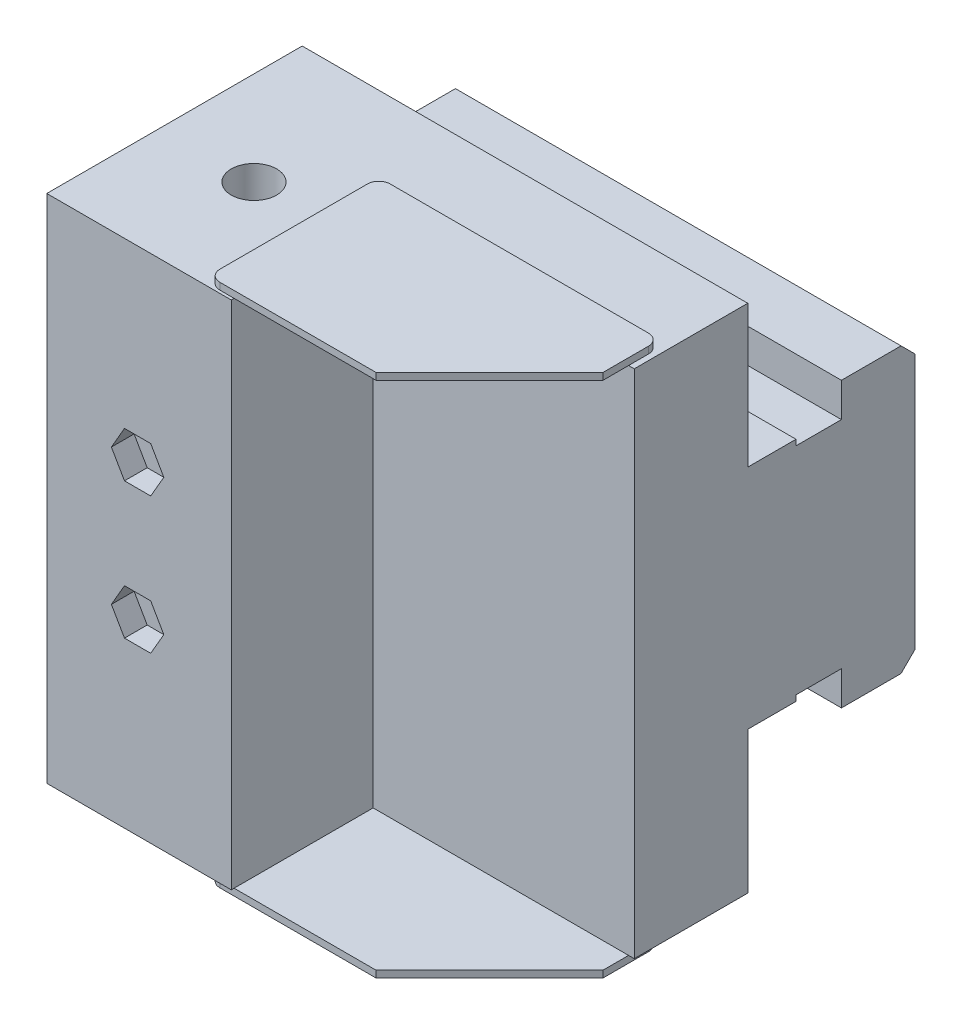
ISO-10303-21;
HEADER;
FILE_DESCRIPTION(('STEP AP214'),'2;1');
FILE_NAME('part.step','',(''),(''),'','','');
FILE_SCHEMA(('AUTOMOTIVE_DESIGN { 1 0 10303 214 1 1 1 1 }'));
ENDSEC;
DATA;
#1=APPLICATION_CONTEXT('core data for automotive mechanical design processes');
#2=APPLICATION_PROTOCOL_DEFINITION('international standard','automotive_design',2000,#1);
#3=PRODUCT_CONTEXT('',#1,'mechanical');
#4=PRODUCT('Part','Part','',(#3));
#5=PRODUCT_RELATED_PRODUCT_CATEGORY('part','',(#4));
#6=PRODUCT_DEFINITION_FORMATION('','',#4);
#7=PRODUCT_DEFINITION_CONTEXT('part definition',#1,'design');
#8=PRODUCT_DEFINITION('design','',#6,#7);
#9=PRODUCT_DEFINITION_SHAPE('','',#8);
#10=(LENGTH_UNIT() NAMED_UNIT(*) SI_UNIT(.MILLI.,.METRE.));
#11=(NAMED_UNIT(*) PLANE_ANGLE_UNIT() SI_UNIT($,.RADIAN.));
#12=(NAMED_UNIT(*) SI_UNIT($,.STERADIAN.) SOLID_ANGLE_UNIT());
#13=UNCERTAINTY_MEASURE_WITH_UNIT(LENGTH_MEASURE(1.E-05),#10,'distance_accuracy_value','');
#14=(GEOMETRIC_REPRESENTATION_CONTEXT(3) GLOBAL_UNCERTAINTY_ASSIGNED_CONTEXT((#13)) GLOBAL_UNIT_ASSIGNED_CONTEXT((#10,
#11,#12)) REPRESENTATION_CONTEXT('',''));
#15=CARTESIAN_POINT('',(0.,0.,0.));
#16=DIRECTION('',(0.,0.,1.));
#17=DIRECTION('',(1.,0.,0.));
#18=AXIS2_PLACEMENT_3D('',#15,#16,#17);
#19=CARTESIAN_POINT('',(78.5003831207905,45.,0.));
#20=DIRECTION('',(0.,0.,1.));
#21=DIRECTION('',(1.,0.,0.));
#22=AXIS2_PLACEMENT_3D('',#19,#20,#21);
#23=PLANE('',#22);
#24=DIRECTION('',(-1.,0.,0.));
#25=VECTOR('',#24,1.);
#26=CARTESIAN_POINT('',(78.5003831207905,-20.,0.));
#27=LINE('',#26,#25);
#28=CARTESIAN_POINT('',(78.5,-20.,0.));
#29=VERTEX_POINT('',#28);
#30=CARTESIAN_POINT('',(0.,-20.,0.));
#31=VERTEX_POINT('',#30);
#32=EDGE_CURVE('E18',#29,#31,#27,.T.);
#33=ORIENTED_EDGE('',*,*,#32,.F.);
#34=DIRECTION('',(0.,-1.,0.));
#35=VECTOR('',#34,1.);
#36=CARTESIAN_POINT('',(78.5,45.,0.));
#37=LINE('',#36,#35);
#38=CARTESIAN_POINT('',(78.5,-45.,0.));
#39=VERTEX_POINT('',#38);
#40=EDGE_CURVE('E386',#29,#39,#37,.T.);
#41=ORIENTED_EDGE('',*,*,#40,.T.);
#42=DIRECTION('',(-1.,0.,0.));
#43=VECTOR('',#42,1.);
#44=CARTESIAN_POINT('',(78.5003831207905,-45.,0.));
#45=LINE('',#44,#43);
#46=CARTESIAN_POINT('',(0.,-45.,0.));
#47=VERTEX_POINT('',#46);
#48=EDGE_CURVE('E488',#39,#47,#45,.T.);
#49=ORIENTED_EDGE('',*,*,#48,.T.);
#50=DIRECTION('',(0.,-1.,0.));
#51=VECTOR('',#50,1.);
#52=CARTESIAN_POINT('',(-9.0205620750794E-13,45.,0.));
#53=LINE('',#52,#51);
#54=EDGE_CURVE('E475',#31,#47,#53,.T.);
#55=ORIENTED_EDGE('',*,*,#54,.F.);
#56=EDGE_LOOP('',(#33,#41,#49,#55));
#57=FACE_BOUND('',#56,.T.);
#58=ADVANCED_FACE('F14',(#57),#23,.F.);
#59=CARTESIAN_POINT('',(-20.,45.,45.));
#60=DIRECTION('',(0.,0.,-1.));
#61=DIRECTION('',(-1.,0.,0.));
#62=AXIS2_PLACEMENT_3D('',#59,#60,#61);
#63=PLANE('',#62);
#64=DIRECTION('',(0.5,0.866025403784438,0.));
#65=VECTOR('',#64,1.);
#66=CARTESIAN_POINT('',(20.618802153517,-12.,45.));
#67=LINE('',#66,#65);
#68=CARTESIAN_POINT('',(18.3094010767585,-16.,45.));
#69=VERTEX_POINT('',#68);
#70=CARTESIAN_POINT('',(20.618802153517,-12.,45.));
#71=VERTEX_POINT('',#70);
#72=EDGE_CURVE('E728',#69,#71,#67,.T.);
#73=ORIENTED_EDGE('',*,*,#72,.F.);
#74=DIRECTION('',(1.,0.,0.));
#75=VECTOR('',#74,1.);
#76=CARTESIAN_POINT('',(18.3094010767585,-16.,45.));
#77=LINE('',#76,#75);
#78=CARTESIAN_POINT('',(13.6905989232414,-16.,45.));
#79=VERTEX_POINT('',#78);
#80=EDGE_CURVE('E731',#79,#69,#77,.T.);
#81=ORIENTED_EDGE('',*,*,#80,.F.);
#82=DIRECTION('',(0.5,-0.86602540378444,0.));
#83=VECTOR('',#82,1.);
#84=CARTESIAN_POINT('',(13.6905989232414,-16.,45.));
#85=LINE('',#84,#83);
#86=CARTESIAN_POINT('',(11.381197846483,-12.,45.));
#87=VERTEX_POINT('',#86);
#88=EDGE_CURVE('E716',#87,#79,#85,.T.);
#89=ORIENTED_EDGE('',*,*,#88,.F.);
#90=DIRECTION('',(-0.5,-0.866025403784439,0.));
#91=VECTOR('',#90,1.);
#92=CARTESIAN_POINT('',(11.381197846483,-12.,45.));
#93=LINE('',#92,#91);
#94=CARTESIAN_POINT('',(13.6905989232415,-8.,45.));
#95=VERTEX_POINT('',#94);
#96=EDGE_CURVE('E719',#95,#87,#93,.T.);
#97=ORIENTED_EDGE('',*,*,#96,.F.);
#98=DIRECTION('',(-1.,0.,0.));
#99=VECTOR('',#98,1.);
#100=CARTESIAN_POINT('',(13.6905989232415,-8.,45.));
#101=LINE('',#100,#99);
#102=CARTESIAN_POINT('',(18.3094010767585,-8.,45.));
#103=VERTEX_POINT('',#102);
#104=EDGE_CURVE('E722',#103,#95,#101,.T.);
#105=ORIENTED_EDGE('',*,*,#104,.F.);
#106=DIRECTION('',(-0.5,0.866025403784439,0.));
#107=VECTOR('',#106,1.);
#108=CARTESIAN_POINT('',(18.3094010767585,-8.,45.));
#109=LINE('',#108,#107);
#110=EDGE_CURVE('E725',#71,#103,#109,.T.);
#111=ORIENTED_EDGE('',*,*,#110,.F.);
#112=EDGE_LOOP('',(#73,#81,#89,#97,#105,#111));
#113=FACE_BOUND('',#112,.T.);
#114=DIRECTION('',(0.5,-0.866025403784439,0.));
#115=VECTOR('',#114,1.);
#116=CARTESIAN_POINT('',(11.381197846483,12.,45.));
#117=LINE('',#116,#115);
#118=CARTESIAN_POINT('',(11.381197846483,12.,45.));
#119=VERTEX_POINT('',#118);
#120=CARTESIAN_POINT('',(13.6905989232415,8.,45.));
#121=VERTEX_POINT('',#120);
#122=EDGE_CURVE('E680',#119,#121,#117,.T.);
#123=ORIENTED_EDGE('',*,*,#122,.F.);
#124=DIRECTION('',(-0.5,-0.86602540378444,0.));
#125=VECTOR('',#124,1.);
#126=CARTESIAN_POINT('',(13.6905989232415,16.,45.));
#127=LINE('',#126,#125);
#128=CARTESIAN_POINT('',(13.6905989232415,16.,45.));
#129=VERTEX_POINT('',#128);
#130=EDGE_CURVE('E683',#129,#119,#127,.T.);
#131=ORIENTED_EDGE('',*,*,#130,.F.);
#132=DIRECTION('',(-1.,0.,0.));
#133=VECTOR('',#132,1.);
#134=CARTESIAN_POINT('',(18.3094010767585,16.,45.));
#135=LINE('',#134,#133);
#136=CARTESIAN_POINT('',(18.3094010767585,16.,45.));
#137=VERTEX_POINT('',#136);
#138=EDGE_CURVE('E668',#137,#129,#135,.T.);
#139=ORIENTED_EDGE('',*,*,#138,.F.);
#140=DIRECTION('',(-0.5,0.866025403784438,0.));
#141=VECTOR('',#140,1.);
#142=CARTESIAN_POINT('',(20.618802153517,12.,45.));
#143=LINE('',#142,#141);
#144=CARTESIAN_POINT('',(20.618802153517,12.,45.));
#145=VERTEX_POINT('',#144);
#146=EDGE_CURVE('E671',#145,#137,#143,.T.);
#147=ORIENTED_EDGE('',*,*,#146,.F.);
#148=DIRECTION('',(0.5,0.866025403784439,0.));
#149=VECTOR('',#148,1.);
#150=CARTESIAN_POINT('',(18.3094010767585,8.,45.));
#151=LINE('',#150,#149);
#152=CARTESIAN_POINT('',(18.3094010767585,8.,45.));
#153=VERTEX_POINT('',#152);
#154=EDGE_CURVE('E674',#153,#145,#151,.T.);
#155=ORIENTED_EDGE('',*,*,#154,.F.);
#156=DIRECTION('',(1.,0.,0.));
#157=VECTOR('',#156,1.);
#158=CARTESIAN_POINT('',(13.6905989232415,8.,45.));
#159=LINE('',#158,#157);
#160=EDGE_CURVE('E677',#121,#153,#159,.T.);
#161=ORIENTED_EDGE('',*,*,#160,.F.);
#162=EDGE_LOOP('',(#123,#131,#139,#147,#155,#161));
#163=FACE_BOUND('',#162,.T.);
#164=DIRECTION('',(1.,0.,0.));
#165=VECTOR('',#164,1.);
#166=CARTESIAN_POINT('',(-20.,-45.,45.));
#167=LINE('',#166,#165);
#168=CARTESIAN_POINT('',(0.,-45.,45.));
#169=VERTEX_POINT('',#168);
#170=CARTESIAN_POINT('',(32.5,-45.,45.));
#171=VERTEX_POINT('',#170);
#172=EDGE_CURVE('E490',#169,#171,#167,.T.);
#173=ORIENTED_EDGE('',*,*,#172,.T.);
#174=DIRECTION('',(0.,-1.,0.));
#175=VECTOR('',#174,1.);
#176=CARTESIAN_POINT('',(32.5,45.,45.));
#177=LINE('',#176,#175);
#178=CARTESIAN_POINT('',(32.5,45.,45.));
#179=VERTEX_POINT('',#178);
#180=EDGE_CURVE('E363',#179,#171,#177,.T.);
#181=ORIENTED_EDGE('',*,*,#180,.F.);
#182=DIRECTION('',(1.,0.,0.));
#183=VECTOR('',#182,1.);
#184=CARTESIAN_POINT('',(-20.,45.,45.));
#185=LINE('',#184,#183);
#186=CARTESIAN_POINT('',(0.,45.,45.));
#187=VERTEX_POINT('',#186);
#188=EDGE_CURVE('E485',#187,#179,#185,.T.);
#189=ORIENTED_EDGE('',*,*,#188,.F.);
#190=DIRECTION('',(0.,-1.,0.));
#191=VECTOR('',#190,1.);
#192=CARTESIAN_POINT('',(0.,45.,45.));
#193=LINE('',#192,#191);
#194=EDGE_CURVE('E735',#187,#169,#193,.T.);
#195=ORIENTED_EDGE('',*,*,#194,.T.);
#196=EDGE_LOOP('',(#173,#181,#189,#195));
#197=FACE_BOUND('',#196,.T.);
#198=ADVANCED_FACE('F16',(#113,#163,#197),#63,.F.);
#199=DIRECTION('',(-1.,0.,0.));
#200=VECTOR('',#199,1.);
#201=CARTESIAN_POINT('',(78.5003831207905,45.,0.));
#202=LINE('',#201,#200);
#203=CARTESIAN_POINT('',(78.5,45.,0.));
#204=VERTEX_POINT('',#203);
#205=CARTESIAN_POINT('',(0.,45.,0.));
#206=VERTEX_POINT('',#205);
#207=EDGE_CURVE('E480',#204,#206,#202,.T.);
#208=ORIENTED_EDGE('',*,*,#207,.F.);
#209=DIRECTION('',(0.,-1.,0.));
#210=VECTOR('',#209,1.);
#211=CARTESIAN_POINT('',(78.5,45.,0.));
#212=LINE('',#211,#210);
#213=CARTESIAN_POINT('',(78.5,20.,0.));
#214=VERTEX_POINT('',#213);
#215=EDGE_CURVE('E378',#204,#214,#212,.T.);
#216=ORIENTED_EDGE('',*,*,#215,.T.);
#217=DIRECTION('',(-1.,0.,0.));
#218=VECTOR('',#217,1.);
#219=CARTESIAN_POINT('',(78.5003831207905,20.,0.));
#220=LINE('',#219,#218);
#221=CARTESIAN_POINT('',(-9.0205620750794E-13,20.,0.));
#222=VERTEX_POINT('',#221);
#223=EDGE_CURVE('E38',#214,#222,#220,.T.);
#224=ORIENTED_EDGE('',*,*,#223,.T.);
#225=EDGE_CURVE('E479',#206,#222,#53,.T.);
#226=ORIENTED_EDGE('',*,*,#225,.F.);
#227=EDGE_LOOP('',(#208,#216,#224,#226));
#228=FACE_BOUND('',#227,.T.);
#229=ADVANCED_FACE('F809',(#228),#23,.F.);
#230=CARTESIAN_POINT('',(-9.5062846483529E-13,45.,45.));
#231=DIRECTION('',(0.,1.,0.));
#232=DIRECTION('',(-1.,0.,0.));
#233=AXIS2_PLACEMENT_3D('',#230,#231,#232);
#234=PLANE('',#233);
#235=DIRECTION('',(1.,0.,0.));
#236=VECTOR('',#235,1.);
#237=CARTESIAN_POINT('',(-58.1406584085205,45.,20.));
#238=LINE('',#237,#236);
#239=CARTESIAN_POINT('',(77.5004604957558,45.,20.));
#240=VERTEX_POINT('',#239);
#241=CARTESIAN_POINT('',(78.5,45.,20.));
#242=VERTEX_POINT('',#241);
#243=EDGE_CURVE('E354',#240,#242,#238,.T.);
#244=ORIENTED_EDGE('',*,*,#243,.T.);
#245=DIRECTION('',(0.,0.,1.));
#246=VECTOR('',#245,1.);
#247=CARTESIAN_POINT('',(78.5,45.,45.));
#248=LINE('',#247,#246);
#249=EDGE_CURVE('E380',#204,#242,#248,.T.);
#250=ORIENTED_EDGE('',*,*,#249,.F.);
#251=ORIENTED_EDGE('',*,*,#207,.T.);
#252=DIRECTION('',(0.,0.,-1.));
#253=VECTOR('',#252,1.);
#254=CARTESIAN_POINT('',(0.,45.,45.));
#255=LINE('',#254,#253);
#256=EDGE_CURVE('E463',#187,#206,#255,.T.);
#257=ORIENTED_EDGE('',*,*,#256,.F.);
#258=ORIENTED_EDGE('',*,*,#188,.T.);
#259=DIRECTION('',(0.,0.,1.));
#260=VECTOR('',#259,1.);
#261=CARTESIAN_POINT('',(32.5,45.,-71.6877919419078));
#262=LINE('',#261,#260);
#263=CARTESIAN_POINT('',(32.5,45.,44.5000386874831));
#264=VERTEX_POINT('',#263);
#265=EDGE_CURVE('E365',#264,#179,#262,.T.);
#266=ORIENTED_EDGE('',*,*,#265,.F.);
#267=DIRECTION('',(1.,0.,0.));
#268=VECTOR('',#267,1.);
#269=CARTESIAN_POINT('',(29.9988298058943,45.,44.5000386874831));
#270=LINE('',#269,#268);
#271=CARTESIAN_POINT('',(29.9988298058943,45.,44.5000386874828));
#272=VERTEX_POINT('',#271);
#273=EDGE_CURVE('E553',#272,#264,#270,.T.);
#274=ORIENTED_EDGE('',*,*,#273,.F.);
#275=CARTESIAN_POINT('',(29.9988298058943,45.,42.5000386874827));
#276=DIRECTION('',(0.,1.,0.));
#277=DIRECTION('',(-1.,0.,0.));
#278=AXIS2_PLACEMENT_3D('',#275,#276,#277);
#279=CIRCLE('',#278,2.00000000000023);
#280=CARTESIAN_POINT('',(27.9988298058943,45.,42.5000386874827));
#281=VERTEX_POINT('',#280);
#282=EDGE_CURVE('E557',#281,#272,#279,.T.);
#283=ORIENTED_EDGE('',*,*,#282,.F.);
#284=DIRECTION('',(0.,0.,1.));
#285=VECTOR('',#284,1.);
#286=CARTESIAN_POINT('',(27.9988298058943,45.,42.5000386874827));
#287=LINE('',#286,#285);
#288=CARTESIAN_POINT('',(27.9988298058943,45.,16.4999791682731));
#289=VERTEX_POINT('',#288);
#290=EDGE_CURVE('E560',#289,#281,#287,.T.);
#291=ORIENTED_EDGE('',*,*,#290,.F.);
#292=CARTESIAN_POINT('',(29.9988298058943,45.,16.4999791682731));
#293=DIRECTION('',(0.,1.,0.));
#294=DIRECTION('',(-1.,0.,0.));
#295=AXIS2_PLACEMENT_3D('',#292,#293,#294);
#296=CIRCLE('',#295,2.);
#297=CARTESIAN_POINT('',(29.9988298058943,45.,14.4999791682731));
#298=VERTEX_POINT('',#297);
#299=EDGE_CURVE('E563',#298,#289,#296,.T.);
#300=ORIENTED_EDGE('',*,*,#299,.F.);
#301=DIRECTION('',(-1.,0.,0.));
#302=VECTOR('',#301,1.);
#303=CARTESIAN_POINT('',(29.9988298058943,45.,14.4999791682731));
#304=LINE('',#303,#302);
#305=CARTESIAN_POINT('',(75.5004604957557,45.,14.4999791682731));
#306=VERTEX_POINT('',#305);
#307=EDGE_CURVE('E566',#306,#298,#304,.T.);
#308=ORIENTED_EDGE('',*,*,#307,.F.);
#309=CARTESIAN_POINT('',(75.5004604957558,45.,16.4999791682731));
#310=DIRECTION('',(0.,1.,0.));
#311=DIRECTION('',(1.,0.,0.));
#312=AXIS2_PLACEMENT_3D('',#309,#310,#311);
#313=CIRCLE('',#312,2.);
#314=CARTESIAN_POINT('',(77.5004604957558,45.,16.4999791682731));
#315=VERTEX_POINT('',#314);
#316=EDGE_CURVE('E569',#315,#306,#313,.T.);
#317=ORIENTED_EDGE('',*,*,#316,.F.);
#318=DIRECTION('',(0.,0.,-1.));
#319=VECTOR('',#318,1.);
#320=CARTESIAN_POINT('',(77.5004604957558,45.,16.4999791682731));
#321=LINE('',#320,#319);
#322=EDGE_CURVE('E551',#240,#315,#321,.T.);
#323=ORIENTED_EDGE('',*,*,#322,.F.);
#324=EDGE_LOOP('',(#244,#250,#251,#257,#258,#266,#274,#283,#291,#300,#308,#317,#323));
#325=FACE_BOUND('',#324,.T.);
#326=CARTESIAN_POINT('',(16.5,45.,25.));
#327=DIRECTION('',(0.,1.,0.));
#328=DIRECTION('',(-1.,0.,0.));
#329=AXIS2_PLACEMENT_3D('',#326,#327,#328);
#330=CIRCLE('',#329,4.);
#331=CARTESIAN_POINT('',(12.5,45.,25.));
#332=VERTEX_POINT('',#331);
#333=EDGE_CURVE('E496',#332,#332,#330,.T.);
#334=ORIENTED_EDGE('',*,*,#333,.F.);
#335=EDGE_LOOP('',(#334));
#336=FACE_BOUND('',#335,.T.);
#337=ADVANCED_FACE('F759',(#325,#336),#234,.T.);
#338=CARTESIAN_POINT('',(-9.5062846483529E-13,-45.,45.));
#339=DIRECTION('',(0.,1.,0.));
#340=DIRECTION('',(-1.,0.,0.));
#341=AXIS2_PLACEMENT_3D('',#338,#339,#340);
#342=PLANE('',#341);
#343=CARTESIAN_POINT('',(16.5,-45.,25.));
#344=DIRECTION('',(0.,-1.,0.));
#345=DIRECTION('',(1.,0.,0.));
#346=AXIS2_PLACEMENT_3D('',#343,#344,#345);
#347=CIRCLE('',#346,4.);
#348=CARTESIAN_POINT('',(20.5,-45.,25.));
#349=VERTEX_POINT('',#348);
#350=EDGE_CURVE('E502',#349,#349,#347,.T.);
#351=ORIENTED_EDGE('',*,*,#350,.F.);
#352=EDGE_LOOP('',(#351));
#353=FACE_BOUND('',#352,.T.);
#354=DIRECTION('',(0.,0.,1.));
#355=VECTOR('',#354,1.);
#356=CARTESIAN_POINT('',(78.5,-45.,45.));
#357=LINE('',#356,#355);
#358=CARTESIAN_POINT('',(78.5,-45.,20.));
#359=VERTEX_POINT('',#358);
#360=EDGE_CURVE('E383',#39,#359,#357,.T.);
#361=ORIENTED_EDGE('',*,*,#360,.T.);
#362=DIRECTION('',(1.,0.,0.));
#363=VECTOR('',#362,1.);
#364=CARTESIAN_POINT('',(-58.1406584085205,-45.,20.));
#365=LINE('',#364,#363);
#366=CARTESIAN_POINT('',(77.5004604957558,-45.,20.));
#367=VERTEX_POINT('',#366);
#368=EDGE_CURVE('E358',#367,#359,#365,.T.);
#369=ORIENTED_EDGE('',*,*,#368,.F.);
#370=DIRECTION('',(0.,0.,-1.));
#371=VECTOR('',#370,1.);
#372=CARTESIAN_POINT('',(77.5004604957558,-45.,16.4999791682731));
#373=LINE('',#372,#371);
#374=CARTESIAN_POINT('',(77.5004604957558,-45.,16.4999791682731));
#375=VERTEX_POINT('',#374);
#376=EDGE_CURVE('E550',#367,#375,#373,.T.);
#377=ORIENTED_EDGE('',*,*,#376,.T.);
#378=CARTESIAN_POINT('',(75.5004604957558,-45.,16.4999791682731));
#379=DIRECTION('',(0.,1.,0.));
#380=DIRECTION('',(1.,0.,0.));
#381=AXIS2_PLACEMENT_3D('',#378,#379,#380);
#382=CIRCLE('',#381,2.);
#383=CARTESIAN_POINT('',(75.5004604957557,-45.,14.4999791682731));
#384=VERTEX_POINT('',#383);
#385=EDGE_CURVE('E633',#375,#384,#382,.T.);
#386=ORIENTED_EDGE('',*,*,#385,.T.);
#387=DIRECTION('',(-1.,0.,0.));
#388=VECTOR('',#387,1.);
#389=CARTESIAN_POINT('',(29.9988298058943,-45.,14.4999791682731));
#390=LINE('',#389,#388);
#391=CARTESIAN_POINT('',(29.9988298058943,-45.,14.4999791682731));
#392=VERTEX_POINT('',#391);
#393=EDGE_CURVE('E616',#384,#392,#390,.T.);
#394=ORIENTED_EDGE('',*,*,#393,.T.);
#395=CARTESIAN_POINT('',(29.9988298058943,-45.,16.4999791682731));
#396=DIRECTION('',(0.,1.,0.));
#397=DIRECTION('',(-1.,0.,0.));
#398=AXIS2_PLACEMENT_3D('',#395,#396,#397);
#399=CIRCLE('',#398,2.);
#400=CARTESIAN_POINT('',(27.9988298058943,-45.,16.4999791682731));
#401=VERTEX_POINT('',#400);
#402=EDGE_CURVE('E619',#392,#401,#399,.T.);
#403=ORIENTED_EDGE('',*,*,#402,.T.);
#404=DIRECTION('',(0.,0.,1.));
#405=VECTOR('',#404,1.);
#406=CARTESIAN_POINT('',(27.9988298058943,-45.,42.5000386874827));
#407=LINE('',#406,#405);
#408=CARTESIAN_POINT('',(27.9988298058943,-45.,42.5000386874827));
#409=VERTEX_POINT('',#408);
#410=EDGE_CURVE('E622',#401,#409,#407,.T.);
#411=ORIENTED_EDGE('',*,*,#410,.T.);
#412=CARTESIAN_POINT('',(29.9988298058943,-45.,42.5000386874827));
#413=DIRECTION('',(0.,1.,0.));
#414=DIRECTION('',(-1.,0.,0.));
#415=AXIS2_PLACEMENT_3D('',#412,#413,#414);
#416=CIRCLE('',#415,2.00000000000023);
#417=CARTESIAN_POINT('',(29.9988298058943,-45.,44.5000386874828));
#418=VERTEX_POINT('',#417);
#419=EDGE_CURVE('E625',#409,#418,#416,.T.);
#420=ORIENTED_EDGE('',*,*,#419,.T.);
#421=DIRECTION('',(1.,0.,0.));
#422=VECTOR('',#421,1.);
#423=CARTESIAN_POINT('',(29.9988298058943,-45.,44.5000386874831));
#424=LINE('',#423,#422);
#425=CARTESIAN_POINT('',(32.5,-45.,44.5000386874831));
#426=VERTEX_POINT('',#425);
#427=EDGE_CURVE('E628',#418,#426,#424,.T.);
#428=ORIENTED_EDGE('',*,*,#427,.T.);
#429=DIRECTION('',(0.,0.,1.));
#430=VECTOR('',#429,1.);
#431=CARTESIAN_POINT('',(32.5,-45.,-71.6877919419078));
#432=LINE('',#431,#430);
#433=EDGE_CURVE('E339',#426,#171,#432,.T.);
#434=ORIENTED_EDGE('',*,*,#433,.T.);
#435=ORIENTED_EDGE('',*,*,#172,.F.);
#436=DIRECTION('',(0.,0.,-1.));
#437=VECTOR('',#436,1.);
#438=CARTESIAN_POINT('',(0.,-45.,45.));
#439=LINE('',#438,#437);
#440=EDGE_CURVE('E733',#169,#47,#439,.T.);
#441=ORIENTED_EDGE('',*,*,#440,.T.);
#442=ORIENTED_EDGE('',*,*,#48,.F.);
#443=EDGE_LOOP('',(#361,#369,#377,#386,#394,#403,#411,#420,#428,#434,#435,#441,#442));
#444=FACE_BOUND('',#443,.T.);
#445=ADVANCED_FACE('F756',(#353,#444),#342,.F.);
#446=CARTESIAN_POINT('',(16.5,25.,25.));
#447=DIRECTION('',(0.,1.,0.));
#448=DIRECTION('',(-1.,0.,0.));
#449=AXIS2_PLACEMENT_3D('',#446,#447,#448);
#450=CYLINDRICAL_SURFACE('',#449,4.);
#451=CARTESIAN_POINT('',(16.5,25.,25.));
#452=DIRECTION('',(0.,1.,0.));
#453=DIRECTION('',(-1.,0.,0.));
#454=AXIS2_PLACEMENT_3D('',#451,#452,#453);
#455=CIRCLE('',#454,4.);
#456=CARTESIAN_POINT('',(12.5,25.,25.));
#457=VERTEX_POINT('',#456);
#458=EDGE_CURVE('E493',#457,#457,#455,.T.);
#459=ORIENTED_EDGE('',*,*,#458,.F.);
#460=EDGE_LOOP('',(#459));
#461=FACE_BOUND('',#460,.T.);
#462=ORIENTED_EDGE('',*,*,#333,.T.);
#463=EDGE_LOOP('',(#462));
#464=FACE_BOUND('',#463,.T.);
#465=ADVANCED_FACE('F1308',(#461,#464),#450,.F.);
#466=CARTESIAN_POINT('',(16.5,25.,25.));
#467=DIRECTION('',(0.,1.,0.));
#468=DIRECTION('',(-1.,0.,0.));
#469=AXIS2_PLACEMENT_3D('',#466,#467,#468);
#470=PLANE('',#469);
#471=ORIENTED_EDGE('',*,*,#458,.T.);
#472=EDGE_LOOP('',(#471));
#473=FACE_BOUND('',#472,.T.);
#474=ADVANCED_FACE('F1297',(#473),#470,.T.);
#475=CARTESIAN_POINT('',(16.5,-25.,25.));
#476=DIRECTION('',(0.,-1.,0.));
#477=DIRECTION('',(1.,0.,0.));
#478=AXIS2_PLACEMENT_3D('',#475,#476,#477);
#479=CYLINDRICAL_SURFACE('',#478,4.);
#480=CARTESIAN_POINT('',(16.5,-25.,25.));
#481=DIRECTION('',(0.,-1.,0.));
#482=DIRECTION('',(1.,0.,0.));
#483=AXIS2_PLACEMENT_3D('',#480,#481,#482);
#484=CIRCLE('',#483,4.);
#485=CARTESIAN_POINT('',(20.5,-25.,25.));
#486=VERTEX_POINT('',#485);
#487=EDGE_CURVE('E499',#486,#486,#484,.T.);
#488=ORIENTED_EDGE('',*,*,#487,.F.);
#489=EDGE_LOOP('',(#488));
#490=FACE_BOUND('',#489,.T.);
#491=ORIENTED_EDGE('',*,*,#350,.T.);
#492=EDGE_LOOP('',(#491));
#493=FACE_BOUND('',#492,.T.);
#494=ADVANCED_FACE('F1286',(#490,#493),#479,.F.);
#495=CARTESIAN_POINT('',(16.5,-25.,25.));
#496=DIRECTION('',(0.,-1.,0.));
#497=DIRECTION('',(1.,0.,0.));
#498=AXIS2_PLACEMENT_3D('',#495,#496,#497);
#499=PLANE('',#498);
#500=ORIENTED_EDGE('',*,*,#487,.T.);
#501=EDGE_LOOP('',(#500));
#502=FACE_BOUND('',#501,.T.);
#503=ADVANCED_FACE('F1276',(#502),#499,.T.);
#504=CARTESIAN_POINT('',(75.5004604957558,46.2,16.4999791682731));
#505=DIRECTION('',(0.,-1.,0.));
#506=DIRECTION('',(1.,0.,0.));
#507=AXIS2_PLACEMENT_3D('',#504,#505,#506);
#508=CYLINDRICAL_SURFACE('',#507,2.);
#509=ORIENTED_EDGE('',*,*,#316,.T.);
#510=DIRECTION('',(0.,-1.,0.));
#511=VECTOR('',#510,1.);
#512=CARTESIAN_POINT('',(75.5004604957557,46.2,14.4999791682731));
#513=LINE('',#512,#511);
#514=CARTESIAN_POINT('',(75.5004604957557,46.2,14.4999791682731));
#515=VERTEX_POINT('',#514);
#516=EDGE_CURVE('E505',#515,#306,#513,.T.);
#517=ORIENTED_EDGE('',*,*,#516,.F.);
#518=CARTESIAN_POINT('',(75.5004604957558,46.2,16.4999791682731));
#519=DIRECTION('',(0.,1.,0.));
#520=DIRECTION('',(1.,0.,0.));
#521=AXIS2_PLACEMENT_3D('',#518,#519,#520);
#522=CIRCLE('',#521,2.);
#523=CARTESIAN_POINT('',(77.5004604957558,46.2,16.4999791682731));
#524=VERTEX_POINT('',#523);
#525=EDGE_CURVE('E543',#524,#515,#522,.T.);
#526=ORIENTED_EDGE('',*,*,#525,.F.);
#527=DIRECTION('',(0.,-1.,0.));
#528=VECTOR('',#527,1.);
#529=CARTESIAN_POINT('',(77.5004604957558,46.2,16.4999791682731));
#530=LINE('',#529,#528);
#531=EDGE_CURVE('E526',#524,#315,#530,.T.);
#532=ORIENTED_EDGE('',*,*,#531,.T.);
#533=EDGE_LOOP('',(#509,#517,#526,#532));
#534=FACE_BOUND('',#533,.T.);
#535=ADVANCED_FACE('F831',(#534),#508,.T.);
#536=CARTESIAN_POINT('',(29.9988298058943,46.2,14.4999791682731));
#537=DIRECTION('',(0.,0.,1.));
#538=DIRECTION('',(1.,0.,0.));
#539=AXIS2_PLACEMENT_3D('',#536,#537,#538);
#540=PLANE('',#539);
#541=ORIENTED_EDGE('',*,*,#307,.T.);
#542=DIRECTION('',(0.,-1.,0.));
#543=VECTOR('',#542,1.);
#544=CARTESIAN_POINT('',(29.9988298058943,46.2,14.4999791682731));
#545=LINE('',#544,#543);
#546=CARTESIAN_POINT('',(29.9988298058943,46.2,14.4999791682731));
#547=VERTEX_POINT('',#546);
#548=EDGE_CURVE('E508',#547,#298,#545,.T.);
#549=ORIENTED_EDGE('',*,*,#548,.F.);
#550=DIRECTION('',(-1.,0.,0.));
#551=VECTOR('',#550,1.);
#552=CARTESIAN_POINT('',(29.9988298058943,46.2,14.4999791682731));
#553=LINE('',#552,#551);
#554=EDGE_CURVE('E541',#515,#547,#553,.T.);
#555=ORIENTED_EDGE('',*,*,#554,.F.);
#556=ORIENTED_EDGE('',*,*,#516,.T.);
#557=EDGE_LOOP('',(#541,#549,#555,#556));
#558=FACE_BOUND('',#557,.T.);
#559=ADVANCED_FACE('F1255',(#558),#540,.F.);
#560=CARTESIAN_POINT('',(29.9988298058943,46.2,16.4999791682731));
#561=DIRECTION('',(0.,-1.,0.));
#562=DIRECTION('',(1.,0.,0.));
#563=AXIS2_PLACEMENT_3D('',#560,#561,#562);
#564=CYLINDRICAL_SURFACE('',#563,2.);
#565=ORIENTED_EDGE('',*,*,#299,.T.);
#566=DIRECTION('',(0.,-1.,0.));
#567=VECTOR('',#566,1.);
#568=CARTESIAN_POINT('',(27.9988298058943,46.2,16.4999791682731));
#569=LINE('',#568,#567);
#570=CARTESIAN_POINT('',(27.9988298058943,46.2,16.4999791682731));
#571=VERTEX_POINT('',#570);
#572=EDGE_CURVE('E511',#571,#289,#569,.T.);
#573=ORIENTED_EDGE('',*,*,#572,.F.);
#574=CARTESIAN_POINT('',(29.9988298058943,46.2,16.4999791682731));
#575=DIRECTION('',(0.,1.,0.));
#576=DIRECTION('',(-1.,0.,0.));
#577=AXIS2_PLACEMENT_3D('',#574,#575,#576);
#578=CIRCLE('',#577,2.);
#579=EDGE_CURVE('E539',#547,#571,#578,.T.);
#580=ORIENTED_EDGE('',*,*,#579,.F.);
#581=ORIENTED_EDGE('',*,*,#548,.T.);
#582=EDGE_LOOP('',(#565,#573,#580,#581));
#583=FACE_BOUND('',#582,.T.);
#584=ADVANCED_FACE('F1244',(#583),#564,.T.);
#585=CARTESIAN_POINT('',(27.9988298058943,46.2,42.5000386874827));
#586=DIRECTION('',(1.,0.,0.));
#587=DIRECTION('',(0.,1.,0.));
#588=AXIS2_PLACEMENT_3D('',#585,#586,#587);
#589=PLANE('',#588);
#590=ORIENTED_EDGE('',*,*,#290,.T.);
#591=DIRECTION('',(0.,-1.,0.));
#592=VECTOR('',#591,1.);
#593=CARTESIAN_POINT('',(27.9988298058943,46.2,42.5000386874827));
#594=LINE('',#593,#592);
#595=CARTESIAN_POINT('',(27.9988298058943,46.2,42.5000386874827));
#596=VERTEX_POINT('',#595);
#597=EDGE_CURVE('E514',#596,#281,#594,.T.);
#598=ORIENTED_EDGE('',*,*,#597,.F.);
#599=DIRECTION('',(0.,0.,1.));
#600=VECTOR('',#599,1.);
#601=CARTESIAN_POINT('',(27.9988298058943,46.2,42.5000386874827));
#602=LINE('',#601,#600);
#603=EDGE_CURVE('E537',#571,#596,#602,.T.);
#604=ORIENTED_EDGE('',*,*,#603,.F.);
#605=ORIENTED_EDGE('',*,*,#572,.T.);
#606=EDGE_LOOP('',(#590,#598,#604,#605));
#607=FACE_BOUND('',#606,.T.);
#608=ADVANCED_FACE('F1231',(#607),#589,.F.);
#609=CARTESIAN_POINT('',(29.9988298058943,46.2,42.5000386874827));
#610=DIRECTION('',(0.,-1.,0.));
#611=DIRECTION('',(1.,0.,0.));
#612=AXIS2_PLACEMENT_3D('',#609,#610,#611);
#613=CYLINDRICAL_SURFACE('',#612,2.00000000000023);
#614=ORIENTED_EDGE('',*,*,#282,.T.);
#615=DIRECTION('',(0.,-1.,0.));
#616=VECTOR('',#615,1.);
#617=CARTESIAN_POINT('',(29.9988298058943,46.2,44.5000386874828));
#618=LINE('',#617,#616);
#619=CARTESIAN_POINT('',(29.9988298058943,46.2,44.5000386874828));
#620=VERTEX_POINT('',#619);
#621=EDGE_CURVE('E517',#620,#272,#618,.T.);
#622=ORIENTED_EDGE('',*,*,#621,.F.);
#623=CARTESIAN_POINT('',(29.9988298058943,46.2,42.5000386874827));
#624=DIRECTION('',(0.,1.,0.));
#625=DIRECTION('',(-1.,0.,0.));
#626=AXIS2_PLACEMENT_3D('',#623,#624,#625);
#627=CIRCLE('',#626,2.00000000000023);
#628=EDGE_CURVE('E535',#596,#620,#627,.T.);
#629=ORIENTED_EDGE('',*,*,#628,.F.);
#630=ORIENTED_EDGE('',*,*,#597,.T.);
#631=EDGE_LOOP('',(#614,#622,#629,#630));
#632=FACE_BOUND('',#631,.T.);
#633=ADVANCED_FACE('F1225',(#632),#613,.T.);
#634=CARTESIAN_POINT('',(29.9988298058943,46.2,44.5000386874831));
#635=DIRECTION('',(0.,0.,-1.));
#636=DIRECTION('',(-1.,0.,0.));
#637=AXIS2_PLACEMENT_3D('',#634,#635,#636);
#638=PLANE('',#637);
#639=ORIENTED_EDGE('',*,*,#273,.T.);
#640=CARTESIAN_POINT('',(57.5004009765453,45.,44.5000386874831));
#641=VERTEX_POINT('',#640);
#642=EDGE_CURVE('E556',#264,#641,#270,.T.);
#643=ORIENTED_EDGE('',*,*,#642,.T.);
#644=DIRECTION('',(0.,-1.,0.));
#645=VECTOR('',#644,1.);
#646=CARTESIAN_POINT('',(57.5004009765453,46.2,44.5000386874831));
#647=LINE('',#646,#645);
#648=CARTESIAN_POINT('',(57.5004009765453,46.2,44.5000386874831));
#649=VERTEX_POINT('',#648);
#650=EDGE_CURVE('E520',#649,#641,#647,.T.);
#651=ORIENTED_EDGE('',*,*,#650,.F.);
#652=DIRECTION('',(1.,0.,0.));
#653=VECTOR('',#652,1.);
#654=CARTESIAN_POINT('',(29.9988298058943,46.2,44.5000386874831));
#655=LINE('',#654,#653);
#656=EDGE_CURVE('E533',#620,#649,#655,.T.);
#657=ORIENTED_EDGE('',*,*,#656,.F.);
#658=ORIENTED_EDGE('',*,*,#621,.T.);
#659=EDGE_LOOP('',(#639,#643,#651,#657,#658));
#660=FACE_BOUND('',#659,.T.);
#661=ADVANCED_FACE('F1230',(#660),#638,.F.);
#662=CARTESIAN_POINT('',(57.5004009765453,46.2,44.5000386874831));
#663=DIRECTION('',(-0.707106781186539,0.,-0.707106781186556));
#664=DIRECTION('',(-0.707106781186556,0.,0.707106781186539));
#665=AXIS2_PLACEMENT_3D('',#662,#663,#664);
#666=PLANE('',#665);
#667=DIRECTION('',(0.707106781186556,0.,-0.707106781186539));
#668=VECTOR('',#667,1.);
#669=CARTESIAN_POINT('',(57.5004009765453,45.,44.5000386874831));
#670=LINE('',#669,#668);
#671=CARTESIAN_POINT('',(77.5004604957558,45.,24.4999791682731));
#672=VERTEX_POINT('',#671);
#673=EDGE_CURVE('E546',#641,#672,#670,.T.);
#674=ORIENTED_EDGE('',*,*,#673,.T.);
#675=DIRECTION('',(0.,-1.,0.));
#676=VECTOR('',#675,1.);
#677=CARTESIAN_POINT('',(77.5004604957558,46.2,24.4999791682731));
#678=LINE('',#677,#676);
#679=CARTESIAN_POINT('',(77.5004604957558,46.2,24.4999791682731));
#680=VERTEX_POINT('',#679);
#681=EDGE_CURVE('E523',#680,#672,#678,.T.);
#682=ORIENTED_EDGE('',*,*,#681,.F.);
#683=DIRECTION('',(0.707106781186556,0.,-0.707106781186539));
#684=VECTOR('',#683,1.);
#685=CARTESIAN_POINT('',(57.5004009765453,46.2,44.5000386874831));
#686=LINE('',#685,#684);
#687=EDGE_CURVE('E531',#649,#680,#686,.T.);
#688=ORIENTED_EDGE('',*,*,#687,.F.);
#689=ORIENTED_EDGE('',*,*,#650,.T.);
#690=EDGE_LOOP('',(#674,#682,#688,#689));
#691=FACE_BOUND('',#690,.T.);
#692=ADVANCED_FACE('F838',(#691),#666,.F.);
#693=CARTESIAN_POINT('',(77.5004604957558,46.2,16.4999791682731));
#694=DIRECTION('',(-1.,0.,0.));
#695=DIRECTION('',(0.,-1.,0.));
#696=AXIS2_PLACEMENT_3D('',#693,#694,#695);
#697=PLANE('',#696);
#698=ORIENTED_EDGE('',*,*,#681,.T.);
#699=EDGE_CURVE('E547',#672,#240,#321,.T.);
#700=ORIENTED_EDGE('',*,*,#699,.T.);
#701=ORIENTED_EDGE('',*,*,#322,.T.);
#702=ORIENTED_EDGE('',*,*,#531,.F.);
#703=DIRECTION('',(0.,0.,-1.));
#704=VECTOR('',#703,1.);
#705=CARTESIAN_POINT('',(77.5004604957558,46.2,16.4999791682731));
#706=LINE('',#705,#704);
#707=EDGE_CURVE('E529',#680,#524,#706,.T.);
#708=ORIENTED_EDGE('',*,*,#707,.F.);
#709=EDGE_LOOP('',(#698,#700,#701,#702,#708));
#710=FACE_BOUND('',#709,.T.);
#711=ADVANCED_FACE('F825',(#710),#697,.F.);
#712=CARTESIAN_POINT('',(75.5004604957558,46.2,16.4999791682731));
#713=DIRECTION('',(0.,-1.,0.));
#714=DIRECTION('',(1.,0.,0.));
#715=AXIS2_PLACEMENT_3D('',#712,#713,#714);
#716=PLANE('',#715);
#717=ORIENTED_EDGE('',*,*,#525,.T.);
#718=ORIENTED_EDGE('',*,*,#554,.T.);
#719=ORIENTED_EDGE('',*,*,#579,.T.);
#720=ORIENTED_EDGE('',*,*,#603,.T.);
#721=ORIENTED_EDGE('',*,*,#628,.T.);
#722=ORIENTED_EDGE('',*,*,#656,.T.);
#723=ORIENTED_EDGE('',*,*,#687,.T.);
#724=ORIENTED_EDGE('',*,*,#707,.T.);
#725=EDGE_LOOP('',(#717,#718,#719,#720,#721,#722,#723,#724));
#726=FACE_BOUND('',#725,.T.);
#727=ADVANCED_FACE('F833',(#726),#716,.F.);
#728=CARTESIAN_POINT('',(75.5004604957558,45.,16.4999791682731));
#729=DIRECTION('',(0.,-1.,0.));
#730=DIRECTION('',(1.,0.,0.));
#731=AXIS2_PLACEMENT_3D('',#728,#729,#730);
#732=PLANE('',#731);
#733=ORIENTED_EDGE('',*,*,#642,.F.);
#734=CARTESIAN_POINT('',(32.5,45.,20.));
#735=VERTEX_POINT('',#734);
#736=EDGE_CURVE('E366',#735,#264,#262,.T.);
#737=ORIENTED_EDGE('',*,*,#736,.F.);
#738=EDGE_CURVE('E353',#735,#240,#238,.T.);
#739=ORIENTED_EDGE('',*,*,#738,.T.);
#740=ORIENTED_EDGE('',*,*,#699,.F.);
#741=ORIENTED_EDGE('',*,*,#673,.F.);
#742=EDGE_LOOP('',(#733,#737,#739,#740,#741));
#743=FACE_BOUND('',#742,.T.);
#744=ADVANCED_FACE('F843',(#743),#732,.T.);
#745=CARTESIAN_POINT('',(75.5004604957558,-45.,16.4999791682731));
#746=DIRECTION('',(0.,1.,0.));
#747=DIRECTION('',(1.,0.,0.));
#748=AXIS2_PLACEMENT_3D('',#745,#746,#747);
#749=PLANE('',#748);
#750=DIRECTION('',(0.707106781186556,0.,-0.707106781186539));
#751=VECTOR('',#750,1.);
#752=CARTESIAN_POINT('',(57.5004009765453,-45.,44.5000386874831));
#753=LINE('',#752,#751);
#754=CARTESIAN_POINT('',(57.5004009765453,-45.,44.5000386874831));
#755=VERTEX_POINT('',#754);
#756=CARTESIAN_POINT('',(77.5004604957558,-45.,24.4999791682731));
#757=VERTEX_POINT('',#756);
#758=EDGE_CURVE('E631',#755,#757,#753,.T.);
#759=ORIENTED_EDGE('',*,*,#758,.T.);
#760=EDGE_CURVE('E24',#757,#367,#373,.T.);
#761=ORIENTED_EDGE('',*,*,#760,.T.);
#762=CARTESIAN_POINT('',(32.5,-45.,20.));
#763=VERTEX_POINT('',#762);
#764=EDGE_CURVE('E350',#763,#367,#365,.T.);
#765=ORIENTED_EDGE('',*,*,#764,.F.);
#766=EDGE_CURVE('E334',#763,#426,#432,.T.);
#767=ORIENTED_EDGE('',*,*,#766,.T.);
#768=EDGE_CURVE('E629',#426,#755,#424,.T.);
#769=ORIENTED_EDGE('',*,*,#768,.T.);
#770=EDGE_LOOP('',(#759,#761,#765,#767,#769));
#771=FACE_BOUND('',#770,.T.);
#772=ADVANCED_FACE('F356',(#771),#749,.T.);
#773=CARTESIAN_POINT('',(75.5004604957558,-46.2,16.4999791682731));
#774=DIRECTION('',(0.,1.,0.));
#775=DIRECTION('',(-1.,0.,0.));
#776=AXIS2_PLACEMENT_3D('',#773,#774,#775);
#777=CYLINDRICAL_SURFACE('',#776,2.);
#778=ORIENTED_EDGE('',*,*,#385,.F.);
#779=DIRECTION('',(0.,1.,0.));
#780=VECTOR('',#779,1.);
#781=CARTESIAN_POINT('',(77.5004604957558,-46.2,16.4999791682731));
#782=LINE('',#781,#780);
#783=CARTESIAN_POINT('',(77.5004604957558,-46.2,16.4999791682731));
#784=VERTEX_POINT('',#783);
#785=EDGE_CURVE('E572',#784,#375,#782,.T.);
#786=ORIENTED_EDGE('',*,*,#785,.F.);
#787=CARTESIAN_POINT('',(75.5004604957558,-46.2,16.4999791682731));
#788=DIRECTION('',(0.,1.,0.));
#789=DIRECTION('',(1.,0.,0.));
#790=AXIS2_PLACEMENT_3D('',#787,#788,#789);
#791=CIRCLE('',#790,2.);
#792=CARTESIAN_POINT('',(75.5004604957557,-46.2,14.4999791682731));
#793=VERTEX_POINT('',#792);
#794=EDGE_CURVE('E613',#784,#793,#791,.T.);
#795=ORIENTED_EDGE('',*,*,#794,.T.);
#796=DIRECTION('',(0.,1.,0.));
#797=VECTOR('',#796,1.);
#798=CARTESIAN_POINT('',(75.5004604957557,-46.2,14.4999791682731));
#799=LINE('',#798,#797);
#800=EDGE_CURVE('E590',#793,#384,#799,.T.);
#801=ORIENTED_EDGE('',*,*,#800,.T.);
#802=EDGE_LOOP('',(#778,#786,#795,#801));
#803=FACE_BOUND('',#802,.T.);
#804=ADVANCED_FACE('F790',(#803),#777,.T.);
#805=CARTESIAN_POINT('',(77.5004604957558,-46.2,16.4999791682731));
#806=DIRECTION('',(1.,0.,0.));
#807=DIRECTION('',(0.,1.,0.));
#808=AXIS2_PLACEMENT_3D('',#805,#806,#807);
#809=PLANE('',#808);
#810=ORIENTED_EDGE('',*,*,#760,.F.);
#811=DIRECTION('',(0.,1.,0.));
#812=VECTOR('',#811,1.);
#813=CARTESIAN_POINT('',(77.5004604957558,-46.2,24.4999791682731));
#814=LINE('',#813,#812);
#815=CARTESIAN_POINT('',(77.5004604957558,-46.2,24.4999791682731));
#816=VERTEX_POINT('',#815);
#817=EDGE_CURVE('E575',#816,#757,#814,.T.);
#818=ORIENTED_EDGE('',*,*,#817,.F.);
#819=DIRECTION('',(0.,0.,-1.));
#820=VECTOR('',#819,1.);
#821=CARTESIAN_POINT('',(77.5004604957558,-46.2,16.4999791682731));
#822=LINE('',#821,#820);
#823=EDGE_CURVE('E610',#816,#784,#822,.T.);
#824=ORIENTED_EDGE('',*,*,#823,.T.);
#825=ORIENTED_EDGE('',*,*,#785,.T.);
#826=ORIENTED_EDGE('',*,*,#376,.F.);
#827=EDGE_LOOP('',(#810,#818,#824,#825,#826));
#828=FACE_BOUND('',#827,.T.);
#829=ADVANCED_FACE('F793',(#828),#809,.T.);
#830=CARTESIAN_POINT('',(57.5004009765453,-46.2,44.5000386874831));
#831=DIRECTION('',(0.707106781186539,0.,0.707106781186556));
#832=DIRECTION('',(0.707106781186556,0.,-0.707106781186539));
#833=AXIS2_PLACEMENT_3D('',#830,#831,#832);
#834=PLANE('',#833);
#835=ORIENTED_EDGE('',*,*,#758,.F.);
#836=DIRECTION('',(0.,1.,0.));
#837=VECTOR('',#836,1.);
#838=CARTESIAN_POINT('',(57.5004009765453,-46.2,44.5000386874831));
#839=LINE('',#838,#837);
#840=CARTESIAN_POINT('',(57.5004009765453,-46.2,44.5000386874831));
#841=VERTEX_POINT('',#840);
#842=EDGE_CURVE('E578',#841,#755,#839,.T.);
#843=ORIENTED_EDGE('',*,*,#842,.F.);
#844=DIRECTION('',(0.707106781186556,0.,-0.707106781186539));
#845=VECTOR('',#844,1.);
#846=CARTESIAN_POINT('',(57.5004009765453,-46.2,44.5000386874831));
#847=LINE('',#846,#845);
#848=EDGE_CURVE('E607',#841,#816,#847,.T.);
#849=ORIENTED_EDGE('',*,*,#848,.T.);
#850=ORIENTED_EDGE('',*,*,#817,.T.);
#851=EDGE_LOOP('',(#835,#843,#849,#850));
#852=FACE_BOUND('',#851,.T.);
#853=ADVANCED_FACE('F797',(#852),#834,.T.);
#854=CARTESIAN_POINT('',(29.9988298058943,-46.2,44.5000386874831));
#855=DIRECTION('',(0.,0.,1.));
#856=DIRECTION('',(1.,0.,0.));
#857=AXIS2_PLACEMENT_3D('',#854,#855,#856);
#858=PLANE('',#857);
#859=ORIENTED_EDGE('',*,*,#427,.F.);
#860=DIRECTION('',(0.,1.,0.));
#861=VECTOR('',#860,1.);
#862=CARTESIAN_POINT('',(29.9988298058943,-46.2,44.5000386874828));
#863=LINE('',#862,#861);
#864=CARTESIAN_POINT('',(29.9988298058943,-46.2,44.5000386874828));
#865=VERTEX_POINT('',#864);
#866=EDGE_CURVE('E581',#865,#418,#863,.T.);
#867=ORIENTED_EDGE('',*,*,#866,.F.);
#868=DIRECTION('',(1.,0.,0.));
#869=VECTOR('',#868,1.);
#870=CARTESIAN_POINT('',(29.9988298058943,-46.2,44.5000386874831));
#871=LINE('',#870,#869);
#872=EDGE_CURVE('E604',#865,#841,#871,.T.);
#873=ORIENTED_EDGE('',*,*,#872,.T.);
#874=ORIENTED_EDGE('',*,*,#842,.T.);
#875=ORIENTED_EDGE('',*,*,#768,.F.);
#876=EDGE_LOOP('',(#859,#867,#873,#874,#875));
#877=FACE_BOUND('',#876,.T.);
#878=ADVANCED_FACE('F767',(#877),#858,.T.);
#879=CARTESIAN_POINT('',(29.9988298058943,-46.2,42.5000386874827));
#880=DIRECTION('',(0.,1.,0.));
#881=DIRECTION('',(-1.,0.,0.));
#882=AXIS2_PLACEMENT_3D('',#879,#880,#881);
#883=CYLINDRICAL_SURFACE('',#882,2.00000000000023);
#884=ORIENTED_EDGE('',*,*,#419,.F.);
#885=DIRECTION('',(0.,1.,0.));
#886=VECTOR('',#885,1.);
#887=CARTESIAN_POINT('',(27.9988298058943,-46.2,42.5000386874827));
#888=LINE('',#887,#886);
#889=CARTESIAN_POINT('',(27.9988298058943,-46.2,42.5000386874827));
#890=VERTEX_POINT('',#889);
#891=EDGE_CURVE('E584',#890,#409,#888,.T.);
#892=ORIENTED_EDGE('',*,*,#891,.F.);
#893=CARTESIAN_POINT('',(29.9988298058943,-46.2,42.5000386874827));
#894=DIRECTION('',(0.,1.,0.));
#895=DIRECTION('',(-1.,0.,0.));
#896=AXIS2_PLACEMENT_3D('',#893,#894,#895);
#897=CIRCLE('',#896,2.00000000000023);
#898=EDGE_CURVE('E601',#890,#865,#897,.T.);
#899=ORIENTED_EDGE('',*,*,#898,.T.);
#900=ORIENTED_EDGE('',*,*,#866,.T.);
#901=EDGE_LOOP('',(#884,#892,#899,#900));
#902=FACE_BOUND('',#901,.T.);
#903=ADVANCED_FACE('F770',(#902),#883,.T.);
#904=CARTESIAN_POINT('',(27.9988298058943,-46.2,42.5000386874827));
#905=DIRECTION('',(-1.,0.,0.));
#906=DIRECTION('',(0.,-1.,0.));
#907=AXIS2_PLACEMENT_3D('',#904,#905,#906);
#908=PLANE('',#907);
#909=ORIENTED_EDGE('',*,*,#410,.F.);
#910=DIRECTION('',(0.,1.,0.));
#911=VECTOR('',#910,1.);
#912=CARTESIAN_POINT('',(27.9988298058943,-46.2,16.4999791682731));
#913=LINE('',#912,#911);
#914=CARTESIAN_POINT('',(27.9988298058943,-46.2,16.4999791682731));
#915=VERTEX_POINT('',#914);
#916=EDGE_CURVE('E586',#915,#401,#913,.T.);
#917=ORIENTED_EDGE('',*,*,#916,.F.);
#918=DIRECTION('',(0.,0.,1.));
#919=VECTOR('',#918,1.);
#920=CARTESIAN_POINT('',(27.9988298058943,-46.2,42.5000386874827));
#921=LINE('',#920,#919);
#922=EDGE_CURVE('E598',#915,#890,#921,.T.);
#923=ORIENTED_EDGE('',*,*,#922,.T.);
#924=ORIENTED_EDGE('',*,*,#891,.T.);
#925=EDGE_LOOP('',(#909,#917,#923,#924));
#926=FACE_BOUND('',#925,.T.);
#927=ADVANCED_FACE('F780',(#926),#908,.T.);
#928=CARTESIAN_POINT('',(29.9988298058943,-46.2,16.4999791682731));
#929=DIRECTION('',(0.,1.,0.));
#930=DIRECTION('',(-1.,0.,0.));
#931=AXIS2_PLACEMENT_3D('',#928,#929,#930);
#932=CYLINDRICAL_SURFACE('',#931,2.);
#933=ORIENTED_EDGE('',*,*,#402,.F.);
#934=DIRECTION('',(0.,1.,0.));
#935=VECTOR('',#934,1.);
#936=CARTESIAN_POINT('',(29.9988298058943,-46.2,14.4999791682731));
#937=LINE('',#936,#935);
#938=CARTESIAN_POINT('',(29.9988298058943,-46.2,14.4999791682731));
#939=VERTEX_POINT('',#938);
#940=EDGE_CURVE('E588',#939,#392,#937,.T.);
#941=ORIENTED_EDGE('',*,*,#940,.F.);
#942=CARTESIAN_POINT('',(29.9988298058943,-46.2,16.4999791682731));
#943=DIRECTION('',(0.,1.,0.));
#944=DIRECTION('',(-1.,0.,0.));
#945=AXIS2_PLACEMENT_3D('',#942,#943,#944);
#946=CIRCLE('',#945,2.);
#947=EDGE_CURVE('E595',#939,#915,#946,.T.);
#948=ORIENTED_EDGE('',*,*,#947,.T.);
#949=ORIENTED_EDGE('',*,*,#916,.T.);
#950=EDGE_LOOP('',(#933,#941,#948,#949));
#951=FACE_BOUND('',#950,.T.);
#952=ADVANCED_FACE('F783',(#951),#932,.T.);
#953=CARTESIAN_POINT('',(29.9988298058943,-46.2,14.4999791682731));
#954=DIRECTION('',(0.,0.,-1.));
#955=DIRECTION('',(-1.,0.,0.));
#956=AXIS2_PLACEMENT_3D('',#953,#954,#955);
#957=PLANE('',#956);
#958=ORIENTED_EDGE('',*,*,#393,.F.);
#959=ORIENTED_EDGE('',*,*,#800,.F.);
#960=DIRECTION('',(-1.,0.,0.));
#961=VECTOR('',#960,1.);
#962=CARTESIAN_POINT('',(29.9988298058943,-46.2,14.4999791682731));
#963=LINE('',#962,#961);
#964=EDGE_CURVE('E592',#793,#939,#963,.T.);
#965=ORIENTED_EDGE('',*,*,#964,.T.);
#966=ORIENTED_EDGE('',*,*,#940,.T.);
#967=EDGE_LOOP('',(#958,#959,#965,#966));
#968=FACE_BOUND('',#967,.T.);
#969=ADVANCED_FACE('F787',(#968),#957,.T.);
#970=CARTESIAN_POINT('',(75.5004604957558,-46.2,16.4999791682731));
#971=DIRECTION('',(0.,1.,0.));
#972=DIRECTION('',(1.,0.,0.));
#973=AXIS2_PLACEMENT_3D('',#970,#971,#972);
#974=PLANE('',#973);
#975=ORIENTED_EDGE('',*,*,#794,.F.);
#976=ORIENTED_EDGE('',*,*,#823,.F.);
#977=ORIENTED_EDGE('',*,*,#848,.F.);
#978=ORIENTED_EDGE('',*,*,#872,.F.);
#979=ORIENTED_EDGE('',*,*,#898,.F.);
#980=ORIENTED_EDGE('',*,*,#922,.F.);
#981=ORIENTED_EDGE('',*,*,#947,.F.);
#982=ORIENTED_EDGE('',*,*,#964,.F.);
#983=EDGE_LOOP('',(#975,#976,#977,#978,#979,#980,#981,#982));
#984=FACE_BOUND('',#983,.T.);
#985=ADVANCED_FACE('F775',(#984),#974,.F.);
#986=CARTESIAN_POINT('',(13.6905989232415,16.,41.));
#987=DIRECTION('',(-0.86602540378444,0.5,0.));
#988=DIRECTION('',(-0.5,-0.86602540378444,0.));
#989=AXIS2_PLACEMENT_3D('',#986,#987,#988);
#990=PLANE('',#989);
#991=ORIENTED_EDGE('',*,*,#130,.T.);
#992=DIRECTION('',(0.,0.,1.));
#993=VECTOR('',#992,1.);
#994=CARTESIAN_POINT('',(11.381197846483,12.,41.));
#995=LINE('',#994,#993);
#996=CARTESIAN_POINT('',(11.381197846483,12.,41.));
#997=VERTEX_POINT('',#996);
#998=EDGE_CURVE('E638',#997,#119,#995,.T.);
#999=ORIENTED_EDGE('',*,*,#998,.F.);
#1000=DIRECTION('',(-0.5,-0.86602540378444,0.));
#1001=VECTOR('',#1000,1.);
#1002=CARTESIAN_POINT('',(13.6905989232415,16.,41.));
#1003=LINE('',#1002,#1001);
#1004=CARTESIAN_POINT('',(13.6905989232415,16.,41.));
#1005=VERTEX_POINT('',#1004);
#1006=EDGE_CURVE('E665',#1005,#997,#1003,.T.);
#1007=ORIENTED_EDGE('',*,*,#1006,.F.);
#1008=DIRECTION('',(0.,0.,1.));
#1009=VECTOR('',#1008,1.);
#1010=CARTESIAN_POINT('',(13.6905989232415,16.,41.));
#1011=LINE('',#1010,#1009);
#1012=EDGE_CURVE('E637',#1005,#129,#1011,.T.);
#1013=ORIENTED_EDGE('',*,*,#1012,.T.);
#1014=EDGE_LOOP('',(#991,#999,#1007,#1013));
#1015=FACE_BOUND('',#1014,.T.);
#1016=ADVANCED_FACE('F971',(#1015),#990,.F.);
#1017=CARTESIAN_POINT('',(18.3094010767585,16.,41.));
#1018=DIRECTION('',(0.,1.,0.));
#1019=DIRECTION('',(-1.,0.,0.));
#1020=AXIS2_PLACEMENT_3D('',#1017,#1018,#1019);
#1021=PLANE('',#1020);
#1022=ORIENTED_EDGE('',*,*,#138,.T.);
#1023=ORIENTED_EDGE('',*,*,#1012,.F.);
#1024=DIRECTION('',(-1.,0.,0.));
#1025=VECTOR('',#1024,1.);
#1026=CARTESIAN_POINT('',(18.3094010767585,16.,41.));
#1027=LINE('',#1026,#1025);
#1028=CARTESIAN_POINT('',(18.3094010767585,16.,41.));
#1029=VERTEX_POINT('',#1028);
#1030=EDGE_CURVE('E642',#1029,#1005,#1027,.T.);
#1031=ORIENTED_EDGE('',*,*,#1030,.F.);
#1032=DIRECTION('',(0.,0.,1.));
#1033=VECTOR('',#1032,1.);
#1034=CARTESIAN_POINT('',(18.3094010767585,16.,41.));
#1035=LINE('',#1034,#1033);
#1036=EDGE_CURVE('E648',#1029,#137,#1035,.T.);
#1037=ORIENTED_EDGE('',*,*,#1036,.T.);
#1038=EDGE_LOOP('',(#1022,#1023,#1031,#1037));
#1039=FACE_BOUND('',#1038,.T.);
#1040=ADVANCED_FACE('F967',(#1039),#1021,.F.);
#1041=CARTESIAN_POINT('',(20.618802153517,12.,41.));
#1042=DIRECTION('',(0.866025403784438,0.5,0.));
#1043=DIRECTION('',(-0.5,0.866025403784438,0.));
#1044=AXIS2_PLACEMENT_3D('',#1041,#1042,#1043);
#1045=PLANE('',#1044);
#1046=ORIENTED_EDGE('',*,*,#146,.T.);
#1047=ORIENTED_EDGE('',*,*,#1036,.F.);
#1048=DIRECTION('',(-0.5,0.866025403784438,0.));
#1049=VECTOR('',#1048,1.);
#1050=CARTESIAN_POINT('',(20.618802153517,12.,41.));
#1051=LINE('',#1050,#1049);
#1052=CARTESIAN_POINT('',(20.618802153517,12.,41.));
#1053=VERTEX_POINT('',#1052);
#1054=EDGE_CURVE('E653',#1053,#1029,#1051,.T.);
#1055=ORIENTED_EDGE('',*,*,#1054,.F.);
#1056=DIRECTION('',(0.,0.,1.));
#1057=VECTOR('',#1056,1.);
#1058=CARTESIAN_POINT('',(20.618802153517,12.,41.));
#1059=LINE('',#1058,#1057);
#1060=EDGE_CURVE('E646',#1053,#145,#1059,.T.);
#1061=ORIENTED_EDGE('',*,*,#1060,.T.);
#1062=EDGE_LOOP('',(#1046,#1047,#1055,#1061));
#1063=FACE_BOUND('',#1062,.T.);
#1064=ADVANCED_FACE('F970',(#1063),#1045,.F.);
#1065=CARTESIAN_POINT('',(18.3094010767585,8.,41.));
#1066=DIRECTION('',(0.866025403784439,-0.5,0.));
#1067=DIRECTION('',(0.5,0.866025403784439,0.));
#1068=AXIS2_PLACEMENT_3D('',#1065,#1066,#1067);
#1069=PLANE('',#1068);
#1070=ORIENTED_EDGE('',*,*,#154,.T.);
#1071=ORIENTED_EDGE('',*,*,#1060,.F.);
#1072=DIRECTION('',(0.5,0.866025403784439,0.));
#1073=VECTOR('',#1072,1.);
#1074=CARTESIAN_POINT('',(18.3094010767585,8.,41.));
#1075=LINE('',#1074,#1073);
#1076=CARTESIAN_POINT('',(18.3094010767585,8.,41.));
#1077=VERTEX_POINT('',#1076);
#1078=EDGE_CURVE('E656',#1077,#1053,#1075,.T.);
#1079=ORIENTED_EDGE('',*,*,#1078,.F.);
#1080=DIRECTION('',(0.,0.,1.));
#1081=VECTOR('',#1080,1.);
#1082=CARTESIAN_POINT('',(18.3094010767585,8.,41.));
#1083=LINE('',#1082,#1081);
#1084=EDGE_CURVE('E644',#1077,#153,#1083,.T.);
#1085=ORIENTED_EDGE('',*,*,#1084,.T.);
#1086=EDGE_LOOP('',(#1070,#1071,#1079,#1085));
#1087=FACE_BOUND('',#1086,.T.);
#1088=ADVANCED_FACE('F975',(#1087),#1069,.F.);
#1089=CARTESIAN_POINT('',(13.6905989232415,8.,41.));
#1090=DIRECTION('',(0.,-1.,0.));
#1091=DIRECTION('',(1.,0.,0.));
#1092=AXIS2_PLACEMENT_3D('',#1089,#1090,#1091);
#1093=PLANE('',#1092);
#1094=ORIENTED_EDGE('',*,*,#160,.T.);
#1095=ORIENTED_EDGE('',*,*,#1084,.F.);
#1096=DIRECTION('',(1.,0.,0.));
#1097=VECTOR('',#1096,1.);
#1098=CARTESIAN_POINT('',(13.6905989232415,8.,41.));
#1099=LINE('',#1098,#1097);
#1100=CARTESIAN_POINT('',(13.6905989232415,8.,41.));
#1101=VERTEX_POINT('',#1100);
#1102=EDGE_CURVE('E659',#1101,#1077,#1099,.T.);
#1103=ORIENTED_EDGE('',*,*,#1102,.F.);
#1104=DIRECTION('',(0.,0.,1.));
#1105=VECTOR('',#1104,1.);
#1106=CARTESIAN_POINT('',(13.6905989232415,8.,41.));
#1107=LINE('',#1106,#1105);
#1108=EDGE_CURVE('E641',#1101,#121,#1107,.T.);
#1109=ORIENTED_EDGE('',*,*,#1108,.T.);
#1110=EDGE_LOOP('',(#1094,#1095,#1103,#1109));
#1111=FACE_BOUND('',#1110,.T.);
#1112=ADVANCED_FACE('F979',(#1111),#1093,.F.);
#1113=CARTESIAN_POINT('',(11.381197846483,12.,41.));
#1114=DIRECTION('',(-0.866025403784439,-0.5,0.));
#1115=DIRECTION('',(0.5,-0.866025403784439,0.));
#1116=AXIS2_PLACEMENT_3D('',#1113,#1114,#1115);
#1117=PLANE('',#1116);
#1118=ORIENTED_EDGE('',*,*,#122,.T.);
#1119=ORIENTED_EDGE('',*,*,#1108,.F.);
#1120=DIRECTION('',(0.5,-0.866025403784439,0.));
#1121=VECTOR('',#1120,1.);
#1122=CARTESIAN_POINT('',(11.381197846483,12.,41.));
#1123=LINE('',#1122,#1121);
#1124=EDGE_CURVE('E662',#997,#1101,#1123,.T.);
#1125=ORIENTED_EDGE('',*,*,#1124,.F.);
#1126=ORIENTED_EDGE('',*,*,#998,.T.);
#1127=EDGE_LOOP('',(#1118,#1119,#1125,#1126));
#1128=FACE_BOUND('',#1127,.T.);
#1129=ADVANCED_FACE('F965',(#1128),#1117,.F.);
#1130=CARTESIAN_POINT('',(9.0717967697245,8.,41.));
#1131=DIRECTION('',(0.,0.,1.));
#1132=DIRECTION('',(1.,0.,0.));
#1133=AXIS2_PLACEMENT_3D('',#1130,#1131,#1132);
#1134=PLANE('',#1133);
#1135=ORIENTED_EDGE('',*,*,#1006,.T.);
#1136=ORIENTED_EDGE('',*,*,#1124,.T.);
#1137=ORIENTED_EDGE('',*,*,#1102,.T.);
#1138=ORIENTED_EDGE('',*,*,#1078,.T.);
#1139=ORIENTED_EDGE('',*,*,#1054,.T.);
#1140=ORIENTED_EDGE('',*,*,#1030,.T.);
#1141=EDGE_LOOP('',(#1135,#1136,#1137,#1138,#1139,#1140));
#1142=FACE_BOUND('',#1141,.T.);
#1143=ADVANCED_FACE('F961',(#1142),#1134,.T.);
#1144=CARTESIAN_POINT('',(18.3094010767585,-16.,41.));
#1145=DIRECTION('',(0.,-1.,0.));
#1146=DIRECTION('',(1.,0.,0.));
#1147=AXIS2_PLACEMENT_3D('',#1144,#1145,#1146);
#1148=PLANE('',#1147);
#1149=ORIENTED_EDGE('',*,*,#80,.T.);
#1150=DIRECTION('',(0.,0.,1.));
#1151=VECTOR('',#1150,1.);
#1152=CARTESIAN_POINT('',(18.3094010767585,-16.,41.));
#1153=LINE('',#1152,#1151);
#1154=CARTESIAN_POINT('',(18.3094010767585,-16.,41.));
#1155=VERTEX_POINT('',#1154);
#1156=EDGE_CURVE('E686',#1155,#69,#1153,.T.);
#1157=ORIENTED_EDGE('',*,*,#1156,.F.);
#1158=DIRECTION('',(1.,0.,0.));
#1159=VECTOR('',#1158,1.);
#1160=CARTESIAN_POINT('',(18.3094010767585,-16.,41.));
#1161=LINE('',#1160,#1159);
#1162=CARTESIAN_POINT('',(13.6905989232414,-16.,41.));
#1163=VERTEX_POINT('',#1162);
#1164=EDGE_CURVE('E713',#1163,#1155,#1161,.T.);
#1165=ORIENTED_EDGE('',*,*,#1164,.F.);
#1166=DIRECTION('',(0.,0.,1.));
#1167=VECTOR('',#1166,1.);
#1168=CARTESIAN_POINT('',(13.6905989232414,-16.,41.));
#1169=LINE('',#1168,#1167);
#1170=EDGE_CURVE('E685',#1163,#79,#1169,.T.);
#1171=ORIENTED_EDGE('',*,*,#1170,.T.);
#1172=EDGE_LOOP('',(#1149,#1157,#1165,#1171));
#1173=FACE_BOUND('',#1172,.T.);
#1174=ADVANCED_FACE('F943',(#1173),#1148,.F.);
#1175=CARTESIAN_POINT('',(13.6905989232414,-16.,41.));
#1176=DIRECTION('',(-0.86602540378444,-0.5,0.));
#1177=DIRECTION('',(0.5,-0.86602540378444,0.));
#1178=AXIS2_PLACEMENT_3D('',#1175,#1176,#1177);
#1179=PLANE('',#1178);
#1180=ORIENTED_EDGE('',*,*,#88,.T.);
#1181=ORIENTED_EDGE('',*,*,#1170,.F.);
#1182=DIRECTION('',(0.5,-0.86602540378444,0.));
#1183=VECTOR('',#1182,1.);
#1184=CARTESIAN_POINT('',(13.6905989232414,-16.,41.));
#1185=LINE('',#1184,#1183);
#1186=CARTESIAN_POINT('',(11.381197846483,-12.,41.));
#1187=VERTEX_POINT('',#1186);
#1188=EDGE_CURVE('E690',#1187,#1163,#1185,.T.);
#1189=ORIENTED_EDGE('',*,*,#1188,.F.);
#1190=DIRECTION('',(0.,0.,1.));
#1191=VECTOR('',#1190,1.);
#1192=CARTESIAN_POINT('',(11.381197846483,-12.,41.));
#1193=LINE('',#1192,#1191);
#1194=EDGE_CURVE('E696',#1187,#87,#1193,.T.);
#1195=ORIENTED_EDGE('',*,*,#1194,.T.);
#1196=EDGE_LOOP('',(#1180,#1181,#1189,#1195));
#1197=FACE_BOUND('',#1196,.T.);
#1198=ADVANCED_FACE('F939',(#1197),#1179,.F.);
#1199=CARTESIAN_POINT('',(11.381197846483,-12.,41.));
#1200=DIRECTION('',(-0.866025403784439,0.5,0.));
#1201=DIRECTION('',(-0.5,-0.866025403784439,0.));
#1202=AXIS2_PLACEMENT_3D('',#1199,#1200,#1201);
#1203=PLANE('',#1202);
#1204=ORIENTED_EDGE('',*,*,#96,.T.);
#1205=ORIENTED_EDGE('',*,*,#1194,.F.);
#1206=DIRECTION('',(-0.5,-0.866025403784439,0.));
#1207=VECTOR('',#1206,1.);
#1208=CARTESIAN_POINT('',(11.381197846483,-12.,41.));
#1209=LINE('',#1208,#1207);
#1210=CARTESIAN_POINT('',(13.6905989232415,-8.,41.));
#1211=VERTEX_POINT('',#1210);
#1212=EDGE_CURVE('E701',#1211,#1187,#1209,.T.);
#1213=ORIENTED_EDGE('',*,*,#1212,.F.);
#1214=DIRECTION('',(0.,0.,1.));
#1215=VECTOR('',#1214,1.);
#1216=CARTESIAN_POINT('',(13.6905989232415,-8.,41.));
#1217=LINE('',#1216,#1215);
#1218=EDGE_CURVE('E694',#1211,#95,#1217,.T.);
#1219=ORIENTED_EDGE('',*,*,#1218,.T.);
#1220=EDGE_LOOP('',(#1204,#1205,#1213,#1219));
#1221=FACE_BOUND('',#1220,.T.);
#1222=ADVANCED_FACE('F942',(#1221),#1203,.F.);
#1223=CARTESIAN_POINT('',(13.6905989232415,-8.,41.));
#1224=DIRECTION('',(0.,1.,0.));
#1225=DIRECTION('',(-1.,0.,0.));
#1226=AXIS2_PLACEMENT_3D('',#1223,#1224,#1225);
#1227=PLANE('',#1226);
#1228=ORIENTED_EDGE('',*,*,#104,.T.);
#1229=ORIENTED_EDGE('',*,*,#1218,.F.);
#1230=DIRECTION('',(-1.,0.,0.));
#1231=VECTOR('',#1230,1.);
#1232=CARTESIAN_POINT('',(13.6905989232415,-8.,41.));
#1233=LINE('',#1232,#1231);
#1234=CARTESIAN_POINT('',(18.3094010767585,-8.,41.));
#1235=VERTEX_POINT('',#1234);
#1236=EDGE_CURVE('E704',#1235,#1211,#1233,.T.);
#1237=ORIENTED_EDGE('',*,*,#1236,.F.);
#1238=DIRECTION('',(0.,0.,1.));
#1239=VECTOR('',#1238,1.);
#1240=CARTESIAN_POINT('',(18.3094010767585,-8.,41.));
#1241=LINE('',#1240,#1239);
#1242=EDGE_CURVE('E692',#1235,#103,#1241,.T.);
#1243=ORIENTED_EDGE('',*,*,#1242,.T.);
#1244=EDGE_LOOP('',(#1228,#1229,#1237,#1243));
#1245=FACE_BOUND('',#1244,.T.);
#1246=ADVANCED_FACE('F947',(#1245),#1227,.F.);
#1247=CARTESIAN_POINT('',(18.3094010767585,-8.,41.));
#1248=DIRECTION('',(0.866025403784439,0.5,0.));
#1249=DIRECTION('',(-0.5,0.866025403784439,0.));
#1250=AXIS2_PLACEMENT_3D('',#1247,#1248,#1249);
#1251=PLANE('',#1250);
#1252=ORIENTED_EDGE('',*,*,#110,.T.);
#1253=ORIENTED_EDGE('',*,*,#1242,.F.);
#1254=DIRECTION('',(-0.5,0.866025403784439,0.));
#1255=VECTOR('',#1254,1.);
#1256=CARTESIAN_POINT('',(18.3094010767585,-8.,41.));
#1257=LINE('',#1256,#1255);
#1258=CARTESIAN_POINT('',(20.618802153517,-12.,41.));
#1259=VERTEX_POINT('',#1258);
#1260=EDGE_CURVE('E707',#1259,#1235,#1257,.T.);
#1261=ORIENTED_EDGE('',*,*,#1260,.F.);
#1262=DIRECTION('',(0.,0.,1.));
#1263=VECTOR('',#1262,1.);
#1264=CARTESIAN_POINT('',(20.618802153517,-12.,41.));
#1265=LINE('',#1264,#1263);
#1266=EDGE_CURVE('E689',#1259,#71,#1265,.T.);
#1267=ORIENTED_EDGE('',*,*,#1266,.T.);
#1268=EDGE_LOOP('',(#1252,#1253,#1261,#1267));
#1269=FACE_BOUND('',#1268,.T.);
#1270=ADVANCED_FACE('F951',(#1269),#1251,.F.);
#1271=CARTESIAN_POINT('',(20.618802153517,-12.,41.));
#1272=DIRECTION('',(0.866025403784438,-0.5,0.));
#1273=DIRECTION('',(0.5,0.866025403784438,0.));
#1274=AXIS2_PLACEMENT_3D('',#1271,#1272,#1273);
#1275=PLANE('',#1274);
#1276=ORIENTED_EDGE('',*,*,#72,.T.);
#1277=ORIENTED_EDGE('',*,*,#1266,.F.);
#1278=DIRECTION('',(0.5,0.866025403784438,0.));
#1279=VECTOR('',#1278,1.);
#1280=CARTESIAN_POINT('',(20.618802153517,-12.,41.));
#1281=LINE('',#1280,#1279);
#1282=EDGE_CURVE('E710',#1155,#1259,#1281,.T.);
#1283=ORIENTED_EDGE('',*,*,#1282,.F.);
#1284=ORIENTED_EDGE('',*,*,#1156,.T.);
#1285=EDGE_LOOP('',(#1276,#1277,#1283,#1284));
#1286=FACE_BOUND('',#1285,.T.);
#1287=ADVANCED_FACE('F937',(#1286),#1275,.F.);
#1288=CARTESIAN_POINT('',(13.6905989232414,-16.,41.));
#1289=DIRECTION('',(0.,0.,-1.));
#1290=DIRECTION('',(-1.,0.,0.));
#1291=AXIS2_PLACEMENT_3D('',#1288,#1289,#1290);
#1292=PLANE('',#1291);
#1293=ORIENTED_EDGE('',*,*,#1164,.T.);
#1294=ORIENTED_EDGE('',*,*,#1282,.T.);
#1295=ORIENTED_EDGE('',*,*,#1260,.T.);
#1296=ORIENTED_EDGE('',*,*,#1236,.T.);
#1297=ORIENTED_EDGE('',*,*,#1212,.T.);
#1298=ORIENTED_EDGE('',*,*,#1188,.T.);
#1299=EDGE_LOOP('',(#1293,#1294,#1295,#1296,#1297,#1298));
#1300=FACE_BOUND('',#1299,.T.);
#1301=ADVANCED_FACE('F934',(#1300),#1292,.F.);
#1302=CARTESIAN_POINT('',(0.,-50.,-20.));
#1303=DIRECTION('',(1.,0.,0.));
#1304=DIRECTION('',(0.,1.,0.));
#1305=AXIS2_PLACEMENT_3D('',#1302,#1303,#1304);
#1306=PLANE('',#1305);
#1307=ORIENTED_EDGE('',*,*,#440,.F.);
#1308=ORIENTED_EDGE('',*,*,#194,.F.);
#1309=ORIENTED_EDGE('',*,*,#256,.T.);
#1310=ORIENTED_EDGE('',*,*,#225,.T.);
#1311=DIRECTION('',(0.,0.,-1.));
#1312=VECTOR('',#1311,1.);
#1313=CARTESIAN_POINT('',(0.,20.,0.));
#1314=LINE('',#1313,#1312);
#1315=CARTESIAN_POINT('',(0.,20.,-8.5));
#1316=VERTEX_POINT('',#1315);
#1317=EDGE_CURVE('E401',#222,#1316,#1314,.T.);
#1318=ORIENTED_EDGE('',*,*,#1317,.T.);
#1319=DIRECTION('',(0.,-1.,0.));
#1320=VECTOR('',#1319,1.);
#1321=CARTESIAN_POINT('',(0.,20.,-8.5));
#1322=LINE('',#1321,#1320);
#1323=CARTESIAN_POINT('',(0.,19.,-8.5));
#1324=VERTEX_POINT('',#1323);
#1325=EDGE_CURVE('E402',#1316,#1324,#1322,.T.);
#1326=ORIENTED_EDGE('',*,*,#1325,.T.);
#1327=DIRECTION('',(0.,0.,-1.));
#1328=VECTOR('',#1327,1.);
#1329=CARTESIAN_POINT('',(0.,19.,-8.5));
#1330=LINE('',#1329,#1328);
#1331=CARTESIAN_POINT('',(0.,19.,-16.5));
#1332=VERTEX_POINT('',#1331);
#1333=EDGE_CURVE('E405',#1324,#1332,#1330,.T.);
#1334=ORIENTED_EDGE('',*,*,#1333,.T.);
#1335=DIRECTION('',(0.,1.,0.));
#1336=VECTOR('',#1335,1.);
#1337=CARTESIAN_POINT('',(0.,19.,-16.5));
#1338=LINE('',#1337,#1336);
#1339=CARTESIAN_POINT('',(0.,25.,-16.5));
#1340=VERTEX_POINT('',#1339);
#1341=EDGE_CURVE('E408',#1332,#1340,#1338,.T.);
#1342=ORIENTED_EDGE('',*,*,#1341,.T.);
#1343=DIRECTION('',(0.,0.,-1.));
#1344=VECTOR('',#1343,1.);
#1345=CARTESIAN_POINT('',(0.,25.,-16.5));
#1346=LINE('',#1345,#1344);
#1347=CARTESIAN_POINT('',(0.,25.,-27.));
#1348=VERTEX_POINT('',#1347);
#1349=EDGE_CURVE('E411',#1340,#1348,#1346,.T.);
#1350=ORIENTED_EDGE('',*,*,#1349,.T.);
#1351=DIRECTION('',(0.,-0.707106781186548,-0.707106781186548));
#1352=VECTOR('',#1351,1.);
#1353=CARTESIAN_POINT('',(0.,25.,-27.));
#1354=LINE('',#1353,#1352);
#1355=CARTESIAN_POINT('',(0.,22.5,-29.5));
#1356=VERTEX_POINT('',#1355);
#1357=EDGE_CURVE('E414',#1348,#1356,#1354,.T.);
#1358=ORIENTED_EDGE('',*,*,#1357,.T.);
#1359=DIRECTION('',(0.,-1.,0.));
#1360=VECTOR('',#1359,1.);
#1361=CARTESIAN_POINT('',(0.,22.5,-29.5));
#1362=LINE('',#1361,#1360);
#1363=CARTESIAN_POINT('',(0.,-22.5,-29.5));
#1364=VERTEX_POINT('',#1363);
#1365=EDGE_CURVE('E417',#1356,#1364,#1362,.T.);
#1366=ORIENTED_EDGE('',*,*,#1365,.T.);
#1367=DIRECTION('',(0.,-0.707106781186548,0.707106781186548));
#1368=VECTOR('',#1367,1.);
#1369=CARTESIAN_POINT('',(0.,-22.5,-29.5));
#1370=LINE('',#1369,#1368);
#1371=CARTESIAN_POINT('',(0.,-25.,-27.));
#1372=VERTEX_POINT('',#1371);
#1373=EDGE_CURVE('E420',#1364,#1372,#1370,.T.);
#1374=ORIENTED_EDGE('',*,*,#1373,.T.);
#1375=DIRECTION('',(0.,0.,1.));
#1376=VECTOR('',#1375,1.);
#1377=CARTESIAN_POINT('',(0.,-25.,-27.));
#1378=LINE('',#1377,#1376);
#1379=CARTESIAN_POINT('',(0.,-25.,-16.5));
#1380=VERTEX_POINT('',#1379);
#1381=EDGE_CURVE('E423',#1372,#1380,#1378,.T.);
#1382=ORIENTED_EDGE('',*,*,#1381,.T.);
#1383=DIRECTION('',(0.,1.,0.));
#1384=VECTOR('',#1383,1.);
#1385=CARTESIAN_POINT('',(0.,-25.,-16.5));
#1386=LINE('',#1385,#1384);
#1387=CARTESIAN_POINT('',(0.,-19.,-16.5));
#1388=VERTEX_POINT('',#1387);
#1389=EDGE_CURVE('E426',#1380,#1388,#1386,.T.);
#1390=ORIENTED_EDGE('',*,*,#1389,.T.);
#1391=DIRECTION('',(0.,0.,1.));
#1392=VECTOR('',#1391,1.);
#1393=CARTESIAN_POINT('',(0.,-19.,-16.5));
#1394=LINE('',#1393,#1392);
#1395=CARTESIAN_POINT('',(0.,-19.,-8.5));
#1396=VERTEX_POINT('',#1395);
#1397=EDGE_CURVE('E429',#1388,#1396,#1394,.T.);
#1398=ORIENTED_EDGE('',*,*,#1397,.T.);
#1399=DIRECTION('',(0.,-1.,0.));
#1400=VECTOR('',#1399,1.);
#1401=CARTESIAN_POINT('',(0.,-19.,-8.5));
#1402=LINE('',#1401,#1400);
#1403=CARTESIAN_POINT('',(0.,-20.,-8.5));
#1404=VERTEX_POINT('',#1403);
#1405=EDGE_CURVE('E432',#1396,#1404,#1402,.T.);
#1406=ORIENTED_EDGE('',*,*,#1405,.T.);
#1407=DIRECTION('',(0.,0.,1.));
#1408=VECTOR('',#1407,1.);
#1409=CARTESIAN_POINT('',(0.,-20.,-8.5));
#1410=LINE('',#1409,#1408);
#1411=EDGE_CURVE('E434',#1404,#31,#1410,.T.);
#1412=ORIENTED_EDGE('',*,*,#1411,.T.);
#1413=ORIENTED_EDGE('',*,*,#54,.T.);
#1414=EDGE_LOOP('',(#1307,#1308,#1309,#1310,#1318,#1326,#1334,#1342,#1350,#1358,#1366,#1374,
#1382,#1390,#1398,#1406,#1412,#1413));
#1415=FACE_BOUND('',#1414,.T.);
#1416=ADVANCED_FACE('F752',(#1415),#1306,.F.);
#1417=CARTESIAN_POINT('',(78.5003831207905,-20.,-8.5));
#1418=DIRECTION('',(0.,-1.,0.));
#1419=DIRECTION('',(1.,0.,0.));
#1420=AXIS2_PLACEMENT_3D('',#1417,#1418,#1419);
#1421=PLANE('',#1420);
#1422=DIRECTION('',(0.,0.,-1.));
#1423=VECTOR('',#1422,1.);
#1424=CARTESIAN_POINT('',(78.5,-20.,-8.5));
#1425=LINE('',#1424,#1423);
#1426=CARTESIAN_POINT('',(78.5,-20.,-8.5));
#1427=VERTEX_POINT('',#1426);
#1428=EDGE_CURVE('E389',#29,#1427,#1425,.T.);
#1429=ORIENTED_EDGE('',*,*,#1428,.F.);
#1430=ORIENTED_EDGE('',*,*,#32,.T.);
#1431=ORIENTED_EDGE('',*,*,#1411,.F.);
#1432=DIRECTION('',(-1.,0.,0.));
#1433=VECTOR('',#1432,1.);
#1434=CARTESIAN_POINT('',(78.5003831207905,-20.,-8.5));
#1435=LINE('',#1434,#1433);
#1436=EDGE_CURVE('E437',#1427,#1404,#1435,.T.);
#1437=ORIENTED_EDGE('',*,*,#1436,.F.);
#1438=EDGE_LOOP('',(#1429,#1430,#1431,#1437));
#1439=FACE_BOUND('',#1438,.T.);
#1440=ADVANCED_FACE('F748',(#1439),#1421,.T.);
#1441=CARTESIAN_POINT('',(78.5003831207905,-19.,-8.5));
#1442=DIRECTION('',(0.,0.,-1.));
#1443=DIRECTION('',(-1.,0.,0.));
#1444=AXIS2_PLACEMENT_3D('',#1441,#1442,#1443);
#1445=PLANE('',#1444);
#1446=DIRECTION('',(0.,1.,0.));
#1447=VECTOR('',#1446,1.);
#1448=CARTESIAN_POINT('',(78.5,-19.,-8.5));
#1449=LINE('',#1448,#1447);
#1450=CARTESIAN_POINT('',(78.5,-19.,-8.5));
#1451=VERTEX_POINT('',#1450);
#1452=EDGE_CURVE('E391',#1427,#1451,#1449,.T.);
#1453=ORIENTED_EDGE('',*,*,#1452,.F.);
#1454=ORIENTED_EDGE('',*,*,#1436,.T.);
#1455=ORIENTED_EDGE('',*,*,#1405,.F.);
#1456=DIRECTION('',(-1.,0.,0.));
#1457=VECTOR('',#1456,1.);
#1458=CARTESIAN_POINT('',(78.5003831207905,-19.,-8.5));
#1459=LINE('',#1458,#1457);
#1460=EDGE_CURVE('E439',#1451,#1396,#1459,.T.);
#1461=ORIENTED_EDGE('',*,*,#1460,.F.);
#1462=EDGE_LOOP('',(#1453,#1454,#1455,#1461));
#1463=FACE_BOUND('',#1462,.T.);
#1464=ADVANCED_FACE('F900',(#1463),#1445,.T.);
#1465=CARTESIAN_POINT('',(78.5003831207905,-19.,-16.5));
#1466=DIRECTION('',(0.,-1.,0.));
#1467=DIRECTION('',(1.,0.,0.));
#1468=AXIS2_PLACEMENT_3D('',#1465,#1466,#1467);
#1469=PLANE('',#1468);
#1470=DIRECTION('',(0.,0.,-1.));
#1471=VECTOR('',#1470,1.);
#1472=CARTESIAN_POINT('',(78.5,-19.,-16.5));
#1473=LINE('',#1472,#1471);
#1474=CARTESIAN_POINT('',(78.5,-19.,-16.5));
#1475=VERTEX_POINT('',#1474);
#1476=EDGE_CURVE('E393',#1451,#1475,#1473,.T.);
#1477=ORIENTED_EDGE('',*,*,#1476,.F.);
#1478=ORIENTED_EDGE('',*,*,#1460,.T.);
#1479=ORIENTED_EDGE('',*,*,#1397,.F.);
#1480=DIRECTION('',(-1.,0.,0.));
#1481=VECTOR('',#1480,1.);
#1482=CARTESIAN_POINT('',(78.5003831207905,-19.,-16.5));
#1483=LINE('',#1482,#1481);
#1484=EDGE_CURVE('E441',#1475,#1388,#1483,.T.);
#1485=ORIENTED_EDGE('',*,*,#1484,.F.);
#1486=EDGE_LOOP('',(#1477,#1478,#1479,#1485));
#1487=FACE_BOUND('',#1486,.T.);
#1488=ADVANCED_FACE('F896',(#1487),#1469,.T.);
#1489=CARTESIAN_POINT('',(78.5003831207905,-25.,-16.5));
#1490=DIRECTION('',(0.,0.,1.));
#1491=DIRECTION('',(0.,-1.,0.));
#1492=AXIS2_PLACEMENT_3D('',#1489,#1490,#1491);
#1493=PLANE('',#1492);
#1494=DIRECTION('',(0.,-1.,0.));
#1495=VECTOR('',#1494,1.);
#1496=CARTESIAN_POINT('',(78.5,-25.,-16.5));
#1497=LINE('',#1496,#1495);
#1498=CARTESIAN_POINT('',(78.5,-25.,-16.5));
#1499=VERTEX_POINT('',#1498);
#1500=EDGE_CURVE('E395',#1475,#1499,#1497,.T.);
#1501=ORIENTED_EDGE('',*,*,#1500,.F.);
#1502=ORIENTED_EDGE('',*,*,#1484,.T.);
#1503=ORIENTED_EDGE('',*,*,#1389,.F.);
#1504=DIRECTION('',(-1.,0.,0.));
#1505=VECTOR('',#1504,1.);
#1506=CARTESIAN_POINT('',(78.5003831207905,-25.,-16.5));
#1507=LINE('',#1506,#1505);
#1508=EDGE_CURVE('E443',#1499,#1380,#1507,.T.);
#1509=ORIENTED_EDGE('',*,*,#1508,.F.);
#1510=EDGE_LOOP('',(#1501,#1502,#1503,#1509));
#1511=FACE_BOUND('',#1510,.T.);
#1512=ADVANCED_FACE('F891',(#1511),#1493,.T.);
#1513=CARTESIAN_POINT('',(78.5003831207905,-25.,-27.));
#1514=DIRECTION('',(0.,-1.,0.));
#1515=DIRECTION('',(0.,0.,-1.));
#1516=AXIS2_PLACEMENT_3D('',#1513,#1514,#1515);
#1517=PLANE('',#1516);
#1518=DIRECTION('',(0.,0.,-1.));
#1519=VECTOR('',#1518,1.);
#1520=CARTESIAN_POINT('',(78.5,-25.,-27.));
#1521=LINE('',#1520,#1519);
#1522=CARTESIAN_POINT('',(78.5,-25.,-27.));
#1523=VERTEX_POINT('',#1522);
#1524=EDGE_CURVE('E397',#1499,#1523,#1521,.T.);
#1525=ORIENTED_EDGE('',*,*,#1524,.F.);
#1526=ORIENTED_EDGE('',*,*,#1508,.T.);
#1527=ORIENTED_EDGE('',*,*,#1381,.F.);
#1528=DIRECTION('',(-1.,0.,0.));
#1529=VECTOR('',#1528,1.);
#1530=CARTESIAN_POINT('',(78.5003831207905,-25.,-27.));
#1531=LINE('',#1530,#1529);
#1532=EDGE_CURVE('E445',#1523,#1372,#1531,.T.);
#1533=ORIENTED_EDGE('',*,*,#1532,.F.);
#1534=EDGE_LOOP('',(#1525,#1526,#1527,#1533));
#1535=FACE_BOUND('',#1534,.T.);
#1536=ADVANCED_FACE('F887',(#1535),#1517,.T.);
#1537=CARTESIAN_POINT('',(78.5003831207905,-22.5,-29.5));
#1538=DIRECTION('',(0.,-0.707106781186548,-0.707106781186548));
#1539=DIRECTION('',(0.,0.707106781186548,-0.707106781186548));
#1540=AXIS2_PLACEMENT_3D('',#1537,#1538,#1539);
#1541=PLANE('',#1540);
#1542=DIRECTION('',(0.,0.707106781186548,-0.707106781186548));
#1543=VECTOR('',#1542,1.);
#1544=CARTESIAN_POINT('',(78.5,-22.5,-29.5));
#1545=LINE('',#1544,#1543);
#1546=CARTESIAN_POINT('',(78.5,-22.5,-29.5));
#1547=VERTEX_POINT('',#1546);
#1548=EDGE_CURVE('E399',#1523,#1547,#1545,.T.);
#1549=ORIENTED_EDGE('',*,*,#1548,.F.);
#1550=ORIENTED_EDGE('',*,*,#1532,.T.);
#1551=ORIENTED_EDGE('',*,*,#1373,.F.);
#1552=DIRECTION('',(-1.,0.,0.));
#1553=VECTOR('',#1552,1.);
#1554=CARTESIAN_POINT('',(78.5003831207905,-22.5,-29.5));
#1555=LINE('',#1554,#1553);
#1556=EDGE_CURVE('E447',#1547,#1364,#1555,.T.);
#1557=ORIENTED_EDGE('',*,*,#1556,.F.);
#1558=EDGE_LOOP('',(#1549,#1550,#1551,#1557));
#1559=FACE_BOUND('',#1558,.T.);
#1560=ADVANCED_FACE('F881',(#1559),#1541,.T.);
#1561=CARTESIAN_POINT('',(78.5003831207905,22.5,-29.5));
#1562=DIRECTION('',(0.,0.,-1.));
#1563=DIRECTION('',(-1.,0.,0.));
#1564=AXIS2_PLACEMENT_3D('',#1561,#1562,#1563);
#1565=PLANE('',#1564);
#1566=DIRECTION('',(0.,1.,0.));
#1567=VECTOR('',#1566,1.);
#1568=CARTESIAN_POINT('',(78.5,49.1764324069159,-29.5));
#1569=LINE('',#1568,#1567);
#1570=CARTESIAN_POINT('',(78.5,22.5,-29.5));
#1571=VERTEX_POINT('',#1570);
#1572=EDGE_CURVE('E344',#1547,#1571,#1569,.T.);
#1573=ORIENTED_EDGE('',*,*,#1572,.F.);
#1574=ORIENTED_EDGE('',*,*,#1556,.T.);
#1575=ORIENTED_EDGE('',*,*,#1365,.F.);
#1576=DIRECTION('',(-1.,0.,0.));
#1577=VECTOR('',#1576,1.);
#1578=CARTESIAN_POINT('',(78.5003831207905,22.5,-29.5));
#1579=LINE('',#1578,#1577);
#1580=EDGE_CURVE('E449',#1571,#1356,#1579,.T.);
#1581=ORIENTED_EDGE('',*,*,#1580,.F.);
#1582=EDGE_LOOP('',(#1573,#1574,#1575,#1581));
#1583=FACE_BOUND('',#1582,.T.);
#1584=ADVANCED_FACE('F876',(#1583),#1565,.T.);
#1585=CARTESIAN_POINT('',(78.5003831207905,25.,-27.));
#1586=DIRECTION('',(0.,0.707106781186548,-0.707106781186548));
#1587=DIRECTION('',(0.,0.707106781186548,0.707106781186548));
#1588=AXIS2_PLACEMENT_3D('',#1585,#1586,#1587);
#1589=PLANE('',#1588);
#1590=DIRECTION('',(0.,0.707106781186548,0.707106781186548));
#1591=VECTOR('',#1590,1.);
#1592=CARTESIAN_POINT('',(78.5,25.,-27.));
#1593=LINE('',#1592,#1591);
#1594=CARTESIAN_POINT('',(78.5,25.,-27.));
#1595=VERTEX_POINT('',#1594);
#1596=EDGE_CURVE('E376',#1571,#1595,#1593,.T.);
#1597=ORIENTED_EDGE('',*,*,#1596,.F.);
#1598=ORIENTED_EDGE('',*,*,#1580,.T.);
#1599=ORIENTED_EDGE('',*,*,#1357,.F.);
#1600=DIRECTION('',(-1.,0.,0.));
#1601=VECTOR('',#1600,1.);
#1602=CARTESIAN_POINT('',(78.5003831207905,25.,-27.));
#1603=LINE('',#1602,#1601);
#1604=EDGE_CURVE('E451',#1595,#1348,#1603,.T.);
#1605=ORIENTED_EDGE('',*,*,#1604,.F.);
#1606=EDGE_LOOP('',(#1597,#1598,#1599,#1605));
#1607=FACE_BOUND('',#1606,.T.);
#1608=ADVANCED_FACE('F872',(#1607),#1589,.T.);
#1609=CARTESIAN_POINT('',(78.5003831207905,25.,-16.5));
#1610=DIRECTION('',(0.,1.,0.));
#1611=DIRECTION('',(-1.,0.,0.));
#1612=AXIS2_PLACEMENT_3D('',#1609,#1610,#1611);
#1613=PLANE('',#1612);
#1614=DIRECTION('',(0.,0.,1.));
#1615=VECTOR('',#1614,1.);
#1616=CARTESIAN_POINT('',(78.5,25.,-16.5));
#1617=LINE('',#1616,#1615);
#1618=CARTESIAN_POINT('',(78.5,25.,-16.5));
#1619=VERTEX_POINT('',#1618);
#1620=EDGE_CURVE('E374',#1595,#1619,#1617,.T.);
#1621=ORIENTED_EDGE('',*,*,#1620,.F.);
#1622=ORIENTED_EDGE('',*,*,#1604,.T.);
#1623=ORIENTED_EDGE('',*,*,#1349,.F.);
#1624=DIRECTION('',(-1.,0.,0.));
#1625=VECTOR('',#1624,1.);
#1626=CARTESIAN_POINT('',(78.5003831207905,25.,-16.5));
#1627=LINE('',#1626,#1625);
#1628=EDGE_CURVE('E453',#1619,#1340,#1627,.T.);
#1629=ORIENTED_EDGE('',*,*,#1628,.F.);
#1630=EDGE_LOOP('',(#1621,#1622,#1623,#1629));
#1631=FACE_BOUND('',#1630,.T.);
#1632=ADVANCED_FACE('F866',(#1631),#1613,.T.);
#1633=CARTESIAN_POINT('',(78.5003831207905,19.,-16.5));
#1634=DIRECTION('',(0.,0.,1.));
#1635=DIRECTION('',(0.,-1.,0.));
#1636=AXIS2_PLACEMENT_3D('',#1633,#1634,#1635);
#1637=PLANE('',#1636);
#1638=DIRECTION('',(0.,-1.,0.));
#1639=VECTOR('',#1638,1.);
#1640=CARTESIAN_POINT('',(78.5,19.,-16.5));
#1641=LINE('',#1640,#1639);
#1642=CARTESIAN_POINT('',(78.5,19.,-16.5));
#1643=VERTEX_POINT('',#1642);
#1644=EDGE_CURVE('E372',#1619,#1643,#1641,.T.);
#1645=ORIENTED_EDGE('',*,*,#1644,.F.);
#1646=ORIENTED_EDGE('',*,*,#1628,.T.);
#1647=ORIENTED_EDGE('',*,*,#1341,.F.);
#1648=DIRECTION('',(-1.,0.,0.));
#1649=VECTOR('',#1648,1.);
#1650=CARTESIAN_POINT('',(78.5003831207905,19.,-16.5));
#1651=LINE('',#1650,#1649);
#1652=EDGE_CURVE('E455',#1643,#1332,#1651,.T.);
#1653=ORIENTED_EDGE('',*,*,#1652,.F.);
#1654=EDGE_LOOP('',(#1645,#1646,#1647,#1653));
#1655=FACE_BOUND('',#1654,.T.);
#1656=ADVANCED_FACE('F861',(#1655),#1637,.T.);
#1657=CARTESIAN_POINT('',(78.5003831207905,19.,-8.5));
#1658=DIRECTION('',(0.,1.,0.));
#1659=DIRECTION('',(-1.,0.,0.));
#1660=AXIS2_PLACEMENT_3D('',#1657,#1658,#1659);
#1661=PLANE('',#1660);
#1662=DIRECTION('',(0.,0.,1.));
#1663=VECTOR('',#1662,1.);
#1664=CARTESIAN_POINT('',(78.5,19.,-8.5));
#1665=LINE('',#1664,#1663);
#1666=CARTESIAN_POINT('',(78.5,19.,-8.5));
#1667=VERTEX_POINT('',#1666);
#1668=EDGE_CURVE('E370',#1643,#1667,#1665,.T.);
#1669=ORIENTED_EDGE('',*,*,#1668,.F.);
#1670=ORIENTED_EDGE('',*,*,#1652,.T.);
#1671=ORIENTED_EDGE('',*,*,#1333,.F.);
#1672=DIRECTION('',(-1.,0.,0.));
#1673=VECTOR('',#1672,1.);
#1674=CARTESIAN_POINT('',(78.5003831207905,19.,-8.5));
#1675=LINE('',#1674,#1673);
#1676=EDGE_CURVE('E457',#1667,#1324,#1675,.T.);
#1677=ORIENTED_EDGE('',*,*,#1676,.F.);
#1678=EDGE_LOOP('',(#1669,#1670,#1671,#1677));
#1679=FACE_BOUND('',#1678,.T.);
#1680=ADVANCED_FACE('F857',(#1679),#1661,.T.);
#1681=CARTESIAN_POINT('',(78.5003831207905,20.,-8.5));
#1682=DIRECTION('',(0.,0.,-1.));
#1683=DIRECTION('',(-1.,0.,0.));
#1684=AXIS2_PLACEMENT_3D('',#1681,#1682,#1683);
#1685=PLANE('',#1684);
#1686=DIRECTION('',(0.,1.,0.));
#1687=VECTOR('',#1686,1.);
#1688=CARTESIAN_POINT('',(78.5,20.,-8.5));
#1689=LINE('',#1688,#1687);
#1690=CARTESIAN_POINT('',(78.5,20.,-8.5));
#1691=VERTEX_POINT('',#1690);
#1692=EDGE_CURVE('E30',#1667,#1691,#1689,.T.);
#1693=ORIENTED_EDGE('',*,*,#1692,.F.);
#1694=ORIENTED_EDGE('',*,*,#1676,.T.);
#1695=ORIENTED_EDGE('',*,*,#1325,.F.);
#1696=DIRECTION('',(-1.,0.,0.));
#1697=VECTOR('',#1696,1.);
#1698=CARTESIAN_POINT('',(78.5003831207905,20.,-8.5));
#1699=LINE('',#1698,#1697);
#1700=EDGE_CURVE('E459',#1691,#1316,#1699,.T.);
#1701=ORIENTED_EDGE('',*,*,#1700,.F.);
#1702=EDGE_LOOP('',(#1693,#1694,#1695,#1701));
#1703=FACE_BOUND('',#1702,.T.);
#1704=ADVANCED_FACE('F851',(#1703),#1685,.T.);
#1705=CARTESIAN_POINT('',(78.5003831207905,20.,0.));
#1706=DIRECTION('',(0.,1.,0.));
#1707=DIRECTION('',(-1.,0.,0.));
#1708=AXIS2_PLACEMENT_3D('',#1705,#1706,#1707);
#1709=PLANE('',#1708);
#1710=DIRECTION('',(0.,0.,1.));
#1711=VECTOR('',#1710,1.);
#1712=CARTESIAN_POINT('',(78.5,20.,0.));
#1713=LINE('',#1712,#1711);
#1714=EDGE_CURVE('E9',#1691,#214,#1713,.T.);
#1715=ORIENTED_EDGE('',*,*,#1714,.F.);
#1716=ORIENTED_EDGE('',*,*,#1700,.T.);
#1717=ORIENTED_EDGE('',*,*,#1317,.F.);
#1718=ORIENTED_EDGE('',*,*,#223,.F.);
#1719=EDGE_LOOP('',(#1715,#1716,#1717,#1718));
#1720=FACE_BOUND('',#1719,.T.);
#1721=ADVANCED_FACE('F848',(#1720),#1709,.T.);
#1722=CARTESIAN_POINT('',(78.5,49.1764324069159,45.));
#1723=DIRECTION('',(-1.,0.,0.));
#1724=DIRECTION('',(0.,-1.,0.));
#1725=AXIS2_PLACEMENT_3D('',#1722,#1723,#1724);
#1726=PLANE('',#1725);
#1727=ORIENTED_EDGE('',*,*,#249,.T.);
#1728=DIRECTION('',(0.,1.,0.));
#1729=VECTOR('',#1728,1.);
#1730=CARTESIAN_POINT('',(78.5,45.,20.));
#1731=LINE('',#1730,#1729);
#1732=EDGE_CURVE('E360',#359,#242,#1731,.T.);
#1733=ORIENTED_EDGE('',*,*,#1732,.F.);
#1734=ORIENTED_EDGE('',*,*,#360,.F.);
#1735=ORIENTED_EDGE('',*,*,#40,.F.);
#1736=ORIENTED_EDGE('',*,*,#1428,.T.);
#1737=ORIENTED_EDGE('',*,*,#1452,.T.);
#1738=ORIENTED_EDGE('',*,*,#1476,.T.);
#1739=ORIENTED_EDGE('',*,*,#1500,.T.);
#1740=ORIENTED_EDGE('',*,*,#1524,.T.);
#1741=ORIENTED_EDGE('',*,*,#1548,.T.);
#1742=ORIENTED_EDGE('',*,*,#1572,.T.);
#1743=ORIENTED_EDGE('',*,*,#1596,.T.);
#1744=ORIENTED_EDGE('',*,*,#1620,.T.);
#1745=ORIENTED_EDGE('',*,*,#1644,.T.);
#1746=ORIENTED_EDGE('',*,*,#1668,.T.);
#1747=ORIENTED_EDGE('',*,*,#1692,.T.);
#1748=ORIENTED_EDGE('',*,*,#1714,.T.);
#1749=ORIENTED_EDGE('',*,*,#215,.F.);
#1750=EDGE_LOOP('',(#1727,#1733,#1734,#1735,#1736,#1737,#1738,#1739,#1740,#1741,#1742,#1743,
#1744,#1745,#1746,#1747,#1748,#1749));
#1751=FACE_BOUND('',#1750,.T.);
#1752=ADVANCED_FACE('F845',(#1751),#1726,.F.);
#1753=CARTESIAN_POINT('',(32.5,45.,-71.6877919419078));
#1754=DIRECTION('',(-1.,0.,0.));
#1755=DIRECTION('',(0.,-1.,0.));
#1756=AXIS2_PLACEMENT_3D('',#1753,#1754,#1755);
#1757=PLANE('',#1756);
#1758=ORIENTED_EDGE('',*,*,#433,.F.);
#1759=ORIENTED_EDGE('',*,*,#766,.F.);
#1760=DIRECTION('',(0.,1.,0.));
#1761=VECTOR('',#1760,1.);
#1762=CARTESIAN_POINT('',(32.5,45.,20.));
#1763=LINE('',#1762,#1761);
#1764=EDGE_CURVE('E337',#763,#735,#1763,.T.);
#1765=ORIENTED_EDGE('',*,*,#1764,.T.);
#1766=ORIENTED_EDGE('',*,*,#736,.T.);
#1767=ORIENTED_EDGE('',*,*,#265,.T.);
#1768=ORIENTED_EDGE('',*,*,#180,.T.);
#1769=EDGE_LOOP('',(#1758,#1759,#1765,#1766,#1767,#1768));
#1770=FACE_BOUND('',#1769,.T.);
#1771=ADVANCED_FACE('F336',(#1770),#1757,.F.);
#1772=CARTESIAN_POINT('',(-58.1406584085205,45.,20.));
#1773=DIRECTION('',(0.,0.,-1.));
#1774=DIRECTION('',(0.,1.,0.));
#1775=AXIS2_PLACEMENT_3D('',#1772,#1773,#1774);
#1776=PLANE('',#1775);
#1777=ORIENTED_EDGE('',*,*,#764,.T.);
#1778=ORIENTED_EDGE('',*,*,#368,.T.);
#1779=ORIENTED_EDGE('',*,*,#1732,.T.);
#1780=ORIENTED_EDGE('',*,*,#243,.F.);
#1781=ORIENTED_EDGE('',*,*,#738,.F.);
#1782=ORIENTED_EDGE('',*,*,#1764,.F.);
#1783=EDGE_LOOP('',(#1777,#1778,#1779,#1780,#1781,#1782));
#1784=FACE_BOUND('',#1783,.T.);
#1785=ADVANCED_FACE('F349',(#1784),#1776,.F.);
#1786=CLOSED_SHELL('',(#58,#198,#229,#337,#445,#465,#474,#494,#503,#535,#559,#584,#608,#633,
#661,#692,#711,#727,#744,#772,#804,#829,#853,#878,#903,#927,#952,#969,#985,#1016,#1040,#1064,
#1088,#1112,#1129,#1143,#1174,#1198,#1222,#1246,#1270,#1287,#1301,#1416,#1440,#1464,#1488,#1512,
#1536,#1560,#1584,#1608,#1632,#1656,#1680,#1704,#1721,#1752,#1771,#1785));
#1787=MANIFOLD_SOLID_BREP('B1',#1786);
#1788=ADVANCED_BREP_SHAPE_REPRESENTATION('',(#18,#1787),#14);
#1789=SHAPE_DEFINITION_REPRESENTATION(#9,#1788);
ENDSEC;
END-ISO-10303-21;
